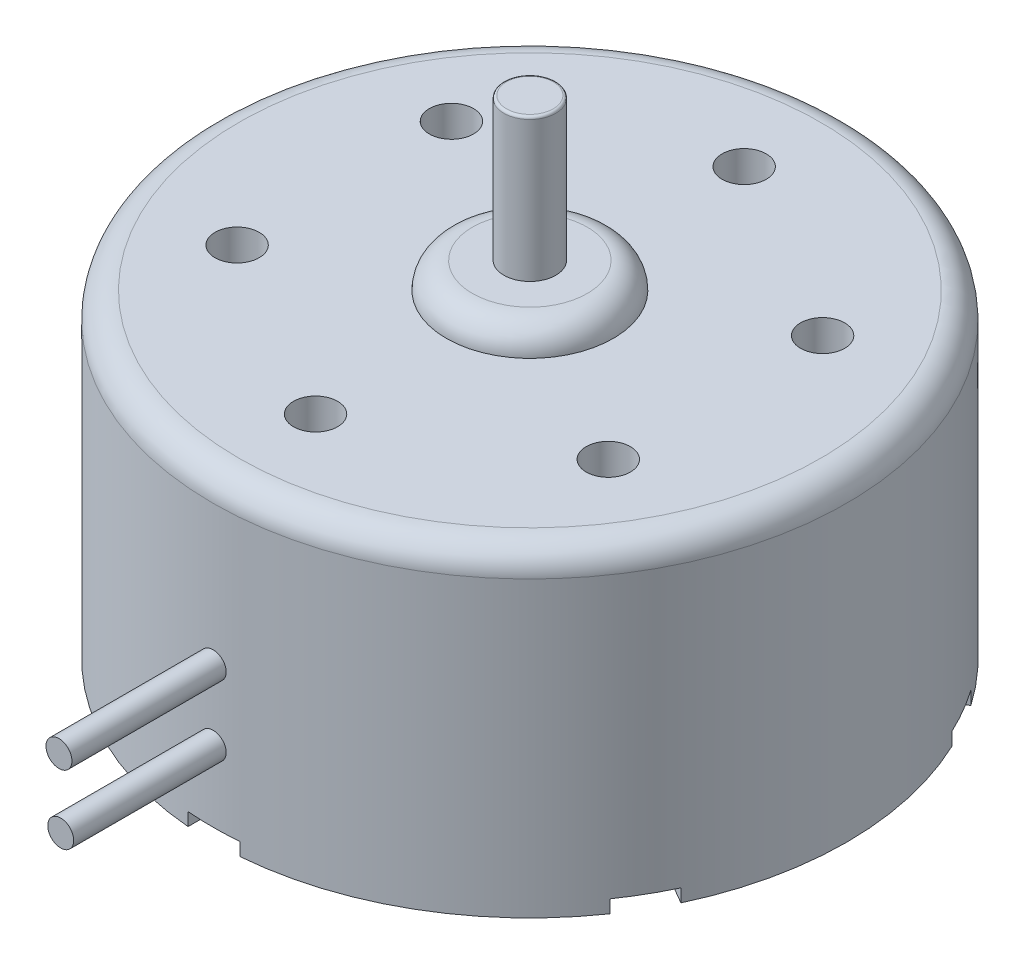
ISO-10303-21;
HEADER;
FILE_DESCRIPTION(('STEP AP214'),'2;1');
FILE_NAME('part.step','',(''),(''),'','','');
FILE_SCHEMA(('AUTOMOTIVE_DESIGN { 1 0 10303 214 1 1 1 1 }'));
ENDSEC;
DATA;
#1=APPLICATION_CONTEXT('core data for automotive mechanical design processes');
#2=APPLICATION_PROTOCOL_DEFINITION('international standard','automotive_design',2000,#1);
#3=PRODUCT_CONTEXT('',#1,'mechanical');
#4=PRODUCT('Part','Part','',(#3));
#5=PRODUCT_RELATED_PRODUCT_CATEGORY('part','',(#4));
#6=PRODUCT_DEFINITION_FORMATION('','',#4);
#7=PRODUCT_DEFINITION_CONTEXT('part definition',#1,'design');
#8=PRODUCT_DEFINITION('design','',#6,#7);
#9=PRODUCT_DEFINITION_SHAPE('','',#8);
#10=(LENGTH_UNIT() NAMED_UNIT(*) SI_UNIT(.MILLI.,.METRE.));
#11=(NAMED_UNIT(*) PLANE_ANGLE_UNIT() SI_UNIT($,.RADIAN.));
#12=(NAMED_UNIT(*) SI_UNIT($,.STERADIAN.) SOLID_ANGLE_UNIT());
#13=UNCERTAINTY_MEASURE_WITH_UNIT(LENGTH_MEASURE(1.E-05),#10,'distance_accuracy_value','');
#14=(GEOMETRIC_REPRESENTATION_CONTEXT(3) GLOBAL_UNCERTAINTY_ASSIGNED_CONTEXT((#13)) GLOBAL_UNIT_ASSIGNED_CONTEXT((#10,
#11,#12)) REPRESENTATION_CONTEXT('',''));
#15=CARTESIAN_POINT('',(0.,0.,0.));
#16=DIRECTION('',(0.,0.,1.));
#17=DIRECTION('',(1.,0.,0.));
#18=AXIS2_PLACEMENT_3D('',#15,#16,#17);
#19=CARTESIAN_POINT('',(0.911703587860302,0.351314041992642,9.53850270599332));
#20=DIRECTION('',(0.,0.,1.));
#21=DIRECTION('',(0.,-1.,0.));
#22=AXIS2_PLACEMENT_3D('',#19,#20,#21);
#23=CYLINDRICAL_SURFACE('',#22,0.5);
#24=CARTESIAN_POINT('',(0.911703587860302,0.351314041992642,9.53850270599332));
#25=DIRECTION('',(0.,0.,-1.));
#26=DIRECTION('',(0.,1.,0.));
#27=AXIS2_PLACEMENT_3D('',#24,#25,#26);
#28=CIRCLE('',#27,0.5);
#29=CARTESIAN_POINT('',(0.911703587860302,0.851314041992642,9.53850270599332));
#30=VERTEX_POINT('',#29);
#31=EDGE_CURVE('P0_E9',#30,#30,#28,.T.);
#32=ORIENTED_EDGE('',*,*,#31,.F.);
#33=EDGE_LOOP('',(#32));
#34=FACE_BOUND('',#33,.T.);
#35=CARTESIAN_POINT('',(0.911703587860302,0.35131404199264,19.5385027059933));
#36=DIRECTION('',(0.,0.,-1.));
#37=DIRECTION('',(0.,1.,0.));
#38=AXIS2_PLACEMENT_3D('',#35,#36,#37);
#39=CIRCLE('',#38,0.5);
#40=CARTESIAN_POINT('',(0.911703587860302,0.851314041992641,19.5385027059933));
#41=VERTEX_POINT('',#40);
#42=EDGE_CURVE('P0_E19',#41,#41,#39,.T.);
#43=ORIENTED_EDGE('',*,*,#42,.T.);
#44=EDGE_LOOP('',(#43));
#45=FACE_BOUND('',#44,.T.);
#46=ADVANCED_FACE('P0_F13',(#34,#45),#23,.T.);
#47=CARTESIAN_POINT('',(0.911703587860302,0.351314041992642,9.53850270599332));
#48=DIRECTION('',(0.,0.,-1.));
#49=DIRECTION('',(0.,1.,0.));
#50=AXIS2_PLACEMENT_3D('',#47,#48,#49);
#51=PLANE('',#50);
#52=ORIENTED_EDGE('',*,*,#31,.T.);
#53=EDGE_LOOP('',(#52));
#54=FACE_BOUND('',#53,.T.);
#55=ADVANCED_FACE('P0_F28',(#54),#51,.T.);
#56=CARTESIAN_POINT('',(0.911703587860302,0.35131404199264,19.5385027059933));
#57=DIRECTION('',(0.,0.,-1.));
#58=DIRECTION('',(0.,1.,0.));
#59=AXIS2_PLACEMENT_3D('',#56,#57,#58);
#60=PLANE('',#59);
#61=ORIENTED_EDGE('',*,*,#42,.F.);
#62=EDGE_LOOP('',(#61));
#63=FACE_BOUND('',#62,.T.);
#64=ADVANCED_FACE('P0_F26',(#63),#60,.F.);
#65=CLOSED_SHELL('',(#46,#55,#64));
#66=MANIFOLD_SOLID_BREP('P0_B1',#65);
#67=CARTESIAN_POINT('',(0.911703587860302,15.9152198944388,1.47878346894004));
#68=DIRECTION('',(0.,-1.,0.));
#69=DIRECTION('',(0.509351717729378,0.,0.860558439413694));
#70=AXIS2_PLACEMENT_3D('',#67,#68,#69);
#71=CYLINDRICAL_SURFACE('',#70,1.);
#72=CARTESIAN_POINT('',(0.911703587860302,-2.78478010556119,1.47878346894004));
#73=DIRECTION('',(0.,1.,0.));
#74=DIRECTION('',(-0.509351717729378,0.,-0.860558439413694));
#75=AXIS2_PLACEMENT_3D('',#72,#73,#74);
#76=CIRCLE('',#75,1.);
#77=CARTESIAN_POINT('',(0.402351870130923,-2.78478010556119,0.618225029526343));
#78=VERTEX_POINT('',#77);
#79=EDGE_CURVE('P1_E20',#78,#78,#76,.T.);
#80=ORIENTED_EDGE('',*,*,#79,.T.);
#81=EDGE_LOOP('',(#80));
#82=FACE_BOUND('',#81,.T.);
#83=CARTESIAN_POINT('',(0.911703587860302,15.8152198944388,1.47878346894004));
#84=DIRECTION('',(0.,1.,0.));
#85=DIRECTION('',(-0.509351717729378,0.,-0.860558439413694));
#86=AXIS2_PLACEMENT_3D('',#83,#84,#85);
#87=CIRCLE('',#86,1.);
#88=CARTESIAN_POINT('',(0.402351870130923,15.8152198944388,0.618225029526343));
#89=VERTEX_POINT('',#88);
#90=EDGE_CURVE('P1_E24',#89,#89,#87,.F.);
#91=ORIENTED_EDGE('',*,*,#90,.T.);
#92=EDGE_LOOP('',(#91));
#93=FACE_BOUND('',#92,.T.);
#94=ADVANCED_FACE('P1_F14',(#82,#93),#71,.T.);
#95=CARTESIAN_POINT('',(0.911703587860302,15.9152198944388,1.47878346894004));
#96=DIRECTION('',(0.,1.,0.));
#97=DIRECTION('',(-0.509351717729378,0.,-0.860558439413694));
#98=AXIS2_PLACEMENT_3D('',#95,#96,#97);
#99=PLANE('',#98);
#100=CARTESIAN_POINT('',(0.911703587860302,15.9152198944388,1.47878346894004));
#101=DIRECTION('',(0.,1.,0.));
#102=DIRECTION('',(-0.509351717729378,0.,-0.860558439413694));
#103=AXIS2_PLACEMENT_3D('',#100,#101,#102);
#104=CIRCLE('',#103,0.900000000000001);
#105=CARTESIAN_POINT('',(0.453287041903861,15.9152198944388,0.704280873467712));
#106=VERTEX_POINT('',#105);
#107=EDGE_CURVE('P1_E28',#106,#106,#104,.T.);
#108=ORIENTED_EDGE('',*,*,#107,.T.);
#109=EDGE_LOOP('',(#108));
#110=FACE_BOUND('',#109,.T.);
#111=ADVANCED_FACE('P1_F34',(#110),#99,.T.);
#112=CARTESIAN_POINT('',(0.911703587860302,-2.88478010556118,1.47878346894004));
#113=DIRECTION('',(0.,1.,0.));
#114=DIRECTION('',(-0.509351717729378,0.,-0.860558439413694));
#115=AXIS2_PLACEMENT_3D('',#112,#113,#114);
#116=PLANE('',#115);
#117=CARTESIAN_POINT('',(0.911703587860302,-2.88478010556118,1.47878346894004));
#118=DIRECTION('',(0.,1.,0.));
#119=DIRECTION('',(-0.509351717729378,0.,-0.860558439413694));
#120=AXIS2_PLACEMENT_3D('',#117,#118,#119);
#121=CIRCLE('',#120,0.900000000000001);
#122=CARTESIAN_POINT('',(0.453287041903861,-2.88478010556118,0.704280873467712));
#123=VERTEX_POINT('',#122);
#124=EDGE_CURVE('P1_E10',#123,#123,#121,.F.);
#125=ORIENTED_EDGE('',*,*,#124,.T.);
#126=EDGE_LOOP('',(#125));
#127=FACE_BOUND('',#126,.T.);
#128=ADVANCED_FACE('P1_F39',(#127),#116,.F.);
#129=CARTESIAN_POINT('',(0.911703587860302,15.8152198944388,1.47878346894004));
#130=DIRECTION('',(0.,1.,0.));
#131=DIRECTION('',(-0.509351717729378,0.,-0.860558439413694));
#132=AXIS2_PLACEMENT_3D('',#129,#130,#131);
#133=TOROIDAL_SURFACE('',#132,0.900000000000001,0.1);
#134=ORIENTED_EDGE('',*,*,#90,.F.);
#135=EDGE_LOOP('',(#134));
#136=FACE_BOUND('',#135,.T.);
#137=ORIENTED_EDGE('',*,*,#107,.F.);
#138=EDGE_LOOP('',(#137));
#139=FACE_BOUND('',#138,.T.);
#140=ADVANCED_FACE('P1_F36',(#136,#139),#133,.T.);
#141=CARTESIAN_POINT('',(0.911703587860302,-2.78478010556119,1.47878346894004));
#142=DIRECTION('',(0.,1.,0.));
#143=DIRECTION('',(-0.509351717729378,0.,-0.860558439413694));
#144=AXIS2_PLACEMENT_3D('',#141,#142,#143);
#145=TOROIDAL_SURFACE('',#144,0.900000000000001,0.1);
#146=ORIENTED_EDGE('',*,*,#124,.F.);
#147=EDGE_LOOP('',(#146));
#148=FACE_BOUND('',#147,.T.);
#149=ORIENTED_EDGE('',*,*,#79,.F.);
#150=EDGE_LOOP('',(#149));
#151=FACE_BOUND('',#150,.T.);
#152=ADVANCED_FACE('P1_F38',(#148,#151),#145,.T.);
#153=CLOSED_SHELL('',(#94,#111,#128,#140,#152));
#154=MANIFOLD_SOLID_BREP('P1_B1',#153);
#155=CARTESIAN_POINT('',(0.911703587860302,9.41521989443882,1.47878346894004));
#156=DIRECTION('',(0.,-1.,0.));
#157=DIRECTION('',(0.,0.,-1.));
#158=AXIS2_PLACEMENT_3D('',#155,#156,#157);
#159=CYLINDRICAL_SURFACE('',#158,12.2);
#160=CARTESIAN_POINT('',(0.911703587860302,8.41521989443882,1.47878346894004));
#161=DIRECTION('',(0.,1.,0.));
#162=DIRECTION('',(0.,0.,1.));
#163=AXIS2_PLACEMENT_3D('',#160,#161,#162);
#164=CIRCLE('',#163,12.2);
#165=CARTESIAN_POINT('',(0.911703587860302,8.41521989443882,13.67878346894));
#166=VERTEX_POINT('',#165);
#167=EDGE_CURVE('P2_E11',#166,#166,#164,.F.);
#168=ORIENTED_EDGE('',*,*,#167,.T.);
#169=EDGE_LOOP('',(#168));
#170=FACE_BOUND('',#169,.T.);
#171=DIRECTION('',(0.,-1.,0.));
#172=VECTOR('',#171,1.);
#173=CARTESIAN_POINT('',(-10.1182536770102,9.41521989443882,-3.73466478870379));
#174=LINE('',#173,#172);
#175=CARTESIAN_POINT('',(-10.1182536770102,-2.88478010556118,-3.73466478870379));
#176=VERTEX_POINT('',#175);
#177=CARTESIAN_POINT('',(-10.1182536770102,-2.38478010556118,-3.73466478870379));
#178=VERTEX_POINT('',#177);
#179=EDGE_CURVE('P2_E199',#176,#178,#174,.F.);
#180=ORIENTED_EDGE('',*,*,#179,.F.);
#181=CARTESIAN_POINT('',(0.911703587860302,-2.88478010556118,1.47878346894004));
#182=DIRECTION('',(0.,1.,0.));
#183=DIRECTION('',(0.,0.,1.));
#184=AXIS2_PLACEMENT_3D('',#181,#182,#183);
#185=CIRCLE('',#184,12.2);
#186=CARTESIAN_POINT('',(-10.1182536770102,-2.88478010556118,6.69223172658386));
#187=VERTEX_POINT('',#186);
#188=EDGE_CURVE('P2_E318',#176,#187,#185,.T.);
#189=ORIENTED_EDGE('',*,*,#188,.T.);
#190=DIRECTION('',(0.,-1.,0.));
#191=VECTOR('',#190,1.);
#192=CARTESIAN_POINT('',(-10.1182536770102,9.41521989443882,6.69223172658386));
#193=LINE('',#192,#191);
#194=CARTESIAN_POINT('',(-10.1182536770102,-2.38478010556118,6.69223172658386));
#195=VERTEX_POINT('',#194);
#196=EDGE_CURVE('P2_E329',#187,#195,#193,.F.);
#197=ORIENTED_EDGE('',*,*,#196,.T.);
#198=CARTESIAN_POINT('',(0.911703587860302,-2.38478010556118,1.47878346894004));
#199=DIRECTION('',(0.,-1.,0.));
#200=DIRECTION('',(0.,0.,-1.));
#201=AXIS2_PLACEMENT_3D('',#198,#199,#200);
#202=CIRCLE('',#201,12.2);
#203=CARTESIAN_POINT('',(-9.11825367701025,-2.38478010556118,8.42428253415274));
#204=VERTEX_POINT('',#203);
#205=EDGE_CURVE('P2_E292',#195,#204,#202,.F.);
#206=ORIENTED_EDGE('',*,*,#205,.T.);
#207=DIRECTION('',(0.,-1.,0.));
#208=VECTOR('',#207,1.);
#209=CARTESIAN_POINT('',(-9.11825367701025,9.41521989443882,8.42428253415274));
#210=LINE('',#209,#208);
#211=CARTESIAN_POINT('',(-9.11825367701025,-2.88478010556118,8.42428253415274));
#212=VERTEX_POINT('',#211);
#213=EDGE_CURVE('P2_E332',#212,#204,#210,.F.);
#214=ORIENTED_EDGE('',*,*,#213,.F.);
#215=CARTESIAN_POINT('',(-0.0882964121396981,-2.88478010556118,13.6377307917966));
#216=VERTEX_POINT('',#215);
#217=EDGE_CURVE('P2_E319',#212,#216,#185,.T.);
#218=ORIENTED_EDGE('',*,*,#217,.T.);
#219=DIRECTION('',(0.,-1.,0.));
#220=VECTOR('',#219,1.);
#221=CARTESIAN_POINT('',(-0.0882964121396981,9.41521989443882,13.6377307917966));
#222=LINE('',#221,#220);
#223=CARTESIAN_POINT('',(-0.0882964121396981,-2.38478010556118,13.6377307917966));
#224=VERTEX_POINT('',#223);
#225=EDGE_CURVE('P2_E338',#216,#224,#222,.F.);
#226=ORIENTED_EDGE('',*,*,#225,.T.);
#227=CARTESIAN_POINT('',(0.911703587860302,-2.38478010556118,1.47878346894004));
#228=DIRECTION('',(0.,-1.,0.));
#229=DIRECTION('',(0.,0.,-1.));
#230=AXIS2_PLACEMENT_3D('',#227,#228,#229);
#231=CIRCLE('',#230,12.2);
#232=CARTESIAN_POINT('',(1.9117035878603,-2.38478010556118,13.6377307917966));
#233=VERTEX_POINT('',#232);
#234=EDGE_CURVE('P2_E273',#224,#233,#231,.F.);
#235=ORIENTED_EDGE('',*,*,#234,.T.);
#236=DIRECTION('',(0.,-1.,0.));
#237=VECTOR('',#236,1.);
#238=CARTESIAN_POINT('',(1.9117035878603,9.41521989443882,13.6377307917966));
#239=LINE('',#238,#237);
#240=CARTESIAN_POINT('',(1.9117035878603,-2.88478010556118,13.6377307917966));
#241=VERTEX_POINT('',#240);
#242=EDGE_CURVE('P2_E341',#241,#233,#239,.F.);
#243=ORIENTED_EDGE('',*,*,#242,.F.);
#244=CARTESIAN_POINT('',(10.9416608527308,-2.88478010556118,8.42428253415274));
#245=VERTEX_POINT('',#244);
#246=EDGE_CURVE('P2_E323',#241,#245,#185,.T.);
#247=ORIENTED_EDGE('',*,*,#246,.T.);
#248=DIRECTION('',(0.,-1.,0.));
#249=VECTOR('',#248,1.);
#250=CARTESIAN_POINT('',(10.9416608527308,9.41521989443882,8.42428253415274));
#251=LINE('',#250,#249);
#252=CARTESIAN_POINT('',(10.9416608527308,-2.38478010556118,8.42428253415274));
#253=VERTEX_POINT('',#252);
#254=EDGE_CURVE('P2_E347',#245,#253,#251,.F.);
#255=ORIENTED_EDGE('',*,*,#254,.T.);
#256=CARTESIAN_POINT('',(0.911703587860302,-2.38478010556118,1.47878346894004));
#257=DIRECTION('',(0.,-1.,0.));
#258=DIRECTION('',(0.,0.,-1.));
#259=AXIS2_PLACEMENT_3D('',#256,#257,#258);
#260=CIRCLE('',#259,12.2);
#261=CARTESIAN_POINT('',(11.9416608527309,-2.38478010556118,6.69223172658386));
#262=VERTEX_POINT('',#261);
#263=EDGE_CURVE('P2_E254',#253,#262,#260,.F.);
#264=ORIENTED_EDGE('',*,*,#263,.T.);
#265=DIRECTION('',(0.,-1.,0.));
#266=VECTOR('',#265,1.);
#267=CARTESIAN_POINT('',(11.9416608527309,9.41521989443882,6.69223172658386));
#268=LINE('',#267,#266);
#269=CARTESIAN_POINT('',(11.9416608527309,-2.88478010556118,6.69223172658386));
#270=VERTEX_POINT('',#269);
#271=EDGE_CURVE('P2_E350',#270,#262,#268,.F.);
#272=ORIENTED_EDGE('',*,*,#271,.F.);
#273=CARTESIAN_POINT('',(11.9416608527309,-2.88478010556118,-3.73466478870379));
#274=VERTEX_POINT('',#273);
#275=EDGE_CURVE('P2_E507',#270,#274,#185,.T.);
#276=ORIENTED_EDGE('',*,*,#275,.T.);
#277=DIRECTION('',(0.,-1.,0.));
#278=VECTOR('',#277,1.);
#279=CARTESIAN_POINT('',(11.9416608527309,9.41521989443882,-3.73466478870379));
#280=LINE('',#279,#278);
#281=CARTESIAN_POINT('',(11.9416608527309,-2.38478010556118,-3.73466478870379));
#282=VERTEX_POINT('',#281);
#283=EDGE_CURVE('P2_E356',#274,#282,#280,.F.);
#284=ORIENTED_EDGE('',*,*,#283,.T.);
#285=CARTESIAN_POINT('',(0.911703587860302,-2.38478010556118,1.47878346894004));
#286=DIRECTION('',(0.,-1.,0.));
#287=DIRECTION('',(0.,0.,-1.));
#288=AXIS2_PLACEMENT_3D('',#285,#286,#287);
#289=CIRCLE('',#288,12.2);
#290=CARTESIAN_POINT('',(10.9416608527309,-2.38478010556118,-5.46671559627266));
#291=VERTEX_POINT('',#290);
#292=EDGE_CURVE('P2_E235',#282,#291,#289,.F.);
#293=ORIENTED_EDGE('',*,*,#292,.T.);
#294=DIRECTION('',(0.,-1.,0.));
#295=VECTOR('',#294,1.);
#296=CARTESIAN_POINT('',(10.9416608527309,9.41521989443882,-5.46671559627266));
#297=LINE('',#296,#295);
#298=CARTESIAN_POINT('',(10.9416608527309,-2.88478010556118,-5.46671559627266));
#299=VERTEX_POINT('',#298);
#300=EDGE_CURVE('P2_E359',#299,#291,#297,.F.);
#301=ORIENTED_EDGE('',*,*,#300,.F.);
#302=CARTESIAN_POINT('',(1.9117035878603,-2.88478010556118,-10.6801638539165));
#303=VERTEX_POINT('',#302);
#304=EDGE_CURVE('P2_E503',#299,#303,#185,.T.);
#305=ORIENTED_EDGE('',*,*,#304,.T.);
#306=DIRECTION('',(0.,-1.,0.));
#307=VECTOR('',#306,1.);
#308=CARTESIAN_POINT('',(1.9117035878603,9.41521989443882,-10.6801638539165));
#309=LINE('',#308,#307);
#310=CARTESIAN_POINT('',(1.9117035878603,-2.38478010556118,-10.6801638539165));
#311=VERTEX_POINT('',#310);
#312=EDGE_CURVE('P2_E365',#303,#311,#309,.F.);
#313=ORIENTED_EDGE('',*,*,#312,.T.);
#314=CARTESIAN_POINT('',(0.911703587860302,-2.38478010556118,1.47878346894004));
#315=DIRECTION('',(0.,-1.,0.));
#316=DIRECTION('',(0.,0.,-1.));
#317=AXIS2_PLACEMENT_3D('',#314,#315,#316);
#318=CIRCLE('',#317,12.2);
#319=CARTESIAN_POINT('',(-0.0882964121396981,-2.38478010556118,-10.6801638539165));
#320=VERTEX_POINT('',#319);
#321=EDGE_CURVE('P2_E216',#311,#320,#318,.F.);
#322=ORIENTED_EDGE('',*,*,#321,.T.);
#323=DIRECTION('',(0.,-1.,0.));
#324=VECTOR('',#323,1.);
#325=CARTESIAN_POINT('',(-0.0882964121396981,9.41521989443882,-10.6801638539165));
#326=LINE('',#325,#324);
#327=CARTESIAN_POINT('',(-0.0882964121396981,-2.88478010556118,-10.6801638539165));
#328=VERTEX_POINT('',#327);
#329=EDGE_CURVE('P2_E368',#328,#320,#326,.F.);
#330=ORIENTED_EDGE('',*,*,#329,.F.);
#331=CARTESIAN_POINT('',(-9.11825367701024,-2.88478010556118,-5.46671559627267));
#332=VERTEX_POINT('',#331);
#333=EDGE_CURVE('P2_E501',#328,#332,#185,.T.);
#334=ORIENTED_EDGE('',*,*,#333,.T.);
#335=DIRECTION('',(0.,-1.,0.));
#336=VECTOR('',#335,1.);
#337=CARTESIAN_POINT('',(-9.11825367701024,9.41521989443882,-5.46671559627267));
#338=LINE('',#337,#336);
#339=CARTESIAN_POINT('',(-9.11825367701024,-2.38478010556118,-5.46671559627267));
#340=VERTEX_POINT('',#339);
#341=EDGE_CURVE('P2_E373',#332,#340,#338,.F.);
#342=ORIENTED_EDGE('',*,*,#341,.T.);
#343=CARTESIAN_POINT('',(0.911703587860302,-2.38478010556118,1.47878346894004));
#344=DIRECTION('',(0.,-1.,0.));
#345=DIRECTION('',(0.,0.,-1.));
#346=AXIS2_PLACEMENT_3D('',#343,#344,#345);
#347=CIRCLE('',#346,12.2);
#348=EDGE_CURVE('P2_E201',#340,#178,#347,.F.);
#349=ORIENTED_EDGE('',*,*,#348,.T.);
#350=EDGE_LOOP('',(#180,#189,#197,#206,#214,#218,#226,#235,#243,#247,#255,#264,#272,#276,#284,
#293,#301,#305,#313,#322,#330,#334,#342,#349));
#351=FACE_BOUND('',#350,.T.);
#352=CARTESIAN_POINT('',(0.911703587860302,2.53563824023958,13.67878346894));
#353=CARTESIAN_POINT('',(0.939776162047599,2.53563948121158,13.678783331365));
#354=CARTESIAN_POINT('',(0.96786879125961,2.53801038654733,13.6786855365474));
#355=CARTESIAN_POINT('',(1.02327949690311,2.54743501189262,13.6783048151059));
#356=CARTESIAN_POINT('',(1.05059661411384,2.55449428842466,13.6780216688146));
#357=CARTESIAN_POINT('',(1.10364557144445,2.57309357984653,13.6773023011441));
#358=CARTESIAN_POINT('',(1.12937819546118,2.58463135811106,13.6768661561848));
#359=CARTESIAN_POINT('',(1.17853431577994,2.61185681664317,13.6758899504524));
#360=CARTESIAN_POINT('',(1.20195836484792,2.62754350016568,13.6753499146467));
#361=CARTESIAN_POINT('',(1.24585651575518,2.6626343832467,13.6742262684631));
#362=CARTESIAN_POINT('',(1.26632875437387,2.68204091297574,13.6736426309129));
#363=CARTESIAN_POINT('',(1.30372634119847,2.72401614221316,13.672497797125));
#364=CARTESIAN_POINT('',(1.32065154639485,2.74658496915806,13.6719366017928));
#365=CARTESIAN_POINT('',(1.35047904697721,2.79425300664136,13.6708997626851));
#366=CARTESIAN_POINT('',(1.36337999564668,2.81935306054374,13.6704241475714));
#367=CARTESIAN_POINT('',(1.38478409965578,2.87136509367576,13.6696124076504));
#368=CARTESIAN_POINT('',(1.3932872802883,2.89827706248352,13.6692762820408));
#369=CARTESIAN_POINT('',(1.40564984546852,2.95313282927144,13.668781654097));
#370=CARTESIAN_POINT('',(1.40951186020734,2.98107603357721,13.6686230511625));
#371=CARTESIAN_POINT('',(1.41249057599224,3.03721454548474,13.6685010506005));
#372=CARTESIAN_POINT('',(1.41160730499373,3.06540985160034,13.6685376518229));
#373=CARTESIAN_POINT('',(1.40512272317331,3.12123435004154,13.668801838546));
#374=CARTESIAN_POINT('',(1.39952425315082,3.14886387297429,13.669029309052));
#375=CARTESIAN_POINT('',(1.38377259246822,3.2027906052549,13.6696494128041));
#376=CARTESIAN_POINT('',(1.37361938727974,3.22908781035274,13.6700420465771));
#377=CARTESIAN_POINT('',(1.3490432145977,3.27961258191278,13.6709483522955));
#378=CARTESIAN_POINT('',(1.33461894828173,3.30383951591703,13.6714620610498));
#379=CARTESIAN_POINT('',(1.30191105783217,3.3495291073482,13.6725525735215));
#380=CARTESIAN_POINT('',(1.28362741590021,3.37099175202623,13.6731293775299));
#381=CARTESIAN_POINT('',(1.24370372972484,3.41056005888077,13.6742815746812));
#382=CARTESIAN_POINT('',(1.22206122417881,3.42866323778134,13.6748569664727));
#383=CARTESIAN_POINT('',(1.17604282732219,3.46097960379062,13.675941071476));
#384=CARTESIAN_POINT('',(1.15166693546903,3.47519279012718,13.6764497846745));
#385=CARTESIAN_POINT('',(1.10087229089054,3.49932545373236,13.6773432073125));
#386=CARTESIAN_POINT('',(1.07445349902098,3.50924484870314,13.6777279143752));
#387=CARTESIAN_POINT('',(1.02032361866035,3.52450675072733,13.6783299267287));
#388=CARTESIAN_POINT('',(0.992612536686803,3.52984928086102,13.6785472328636));
#389=CARTESIAN_POINT('',(0.936706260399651,3.53580274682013,13.6787898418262));
#390=CARTESIAN_POINT('',(0.908511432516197,3.5364171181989,13.6788152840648));
#391=CARTESIAN_POINT('',(0.852419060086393,3.53290578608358,13.6786716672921));
#392=CARTESIAN_POINT('',(0.82452151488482,3.52878009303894,13.6785026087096));
#393=CARTESIAN_POINT('',(0.769825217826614,3.51590858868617,13.6779891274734));
#394=CARTESIAN_POINT('',(0.743026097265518,3.50716434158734,13.6776447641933));
#395=CARTESIAN_POINT('',(0.691276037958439,3.48530553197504,13.6768194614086));
#396=CARTESIAN_POINT('',(0.666325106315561,3.47219095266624,13.676338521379));
#397=CARTESIAN_POINT('',(0.618963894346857,3.44195493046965,13.6752938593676));
#398=CARTESIAN_POINT('',(0.596555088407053,3.42483117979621,13.6747300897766));
#399=CARTESIAN_POINT('',(0.554929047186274,3.38706627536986,13.6735834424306));
#400=CARTESIAN_POINT('',(0.535711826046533,3.36642510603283,13.6730005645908));
#401=CARTESIAN_POINT('',(0.501002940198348,3.32219653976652,13.6718810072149));
#402=CARTESIAN_POINT('',(0.485513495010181,3.29860740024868,13.6713443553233));
#403=CARTESIAN_POINT('',(0.458715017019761,3.24916134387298,13.6703781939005));
#404=CARTESIAN_POINT('',(0.447405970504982,3.22330443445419,13.6699486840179));
#405=CARTESIAN_POINT('',(0.429293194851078,3.1700651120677,13.6692454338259));
#406=CARTESIAN_POINT('',(0.422488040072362,3.14268318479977,13.6689716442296));
#407=CARTESIAN_POINT('',(0.413571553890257,3.08716426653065,13.6686105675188));
#408=CARTESIAN_POINT('',(0.41146020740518,3.05902727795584,13.6685232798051));
#409=CARTESIAN_POINT('',(0.41199143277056,3.00281907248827,13.6685450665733));
#410=CARTESIAN_POINT('',(0.414630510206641,2.9747478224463,13.6686539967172));
#411=CARTESIAN_POINT('',(0.424580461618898,2.91944722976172,13.6690556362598));
#412=CARTESIAN_POINT('',(0.431891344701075,2.8922178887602,13.6693483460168));
#413=CARTESIAN_POINT('',(0.450976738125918,2.83937312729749,13.6700845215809));
#414=CARTESIAN_POINT('',(0.462751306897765,2.81375772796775,13.6705279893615));
#415=CARTESIAN_POINT('',(0.490429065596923,2.76486744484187,13.6715156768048));
#416=CARTESIAN_POINT('',(0.506332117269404,2.74159248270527,13.6720598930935));
#417=CARTESIAN_POINT('',(0.541827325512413,2.69802669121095,13.6731881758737));
#418=CARTESIAN_POINT('',(0.561421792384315,2.6777377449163,13.6737722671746));
#419=CARTESIAN_POINT('',(0.603744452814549,2.64073140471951,13.6749143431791));
#420=CARTESIAN_POINT('',(0.626473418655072,2.6240148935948,13.6754723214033));
#421=CARTESIAN_POINT('',(0.674433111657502,2.59462269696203,13.676499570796));
#422=CARTESIAN_POINT('',(0.699665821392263,2.58195024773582,13.6769687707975));
#423=CARTESIAN_POINT('',(0.751883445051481,2.56103656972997,13.6777644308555));
#424=CARTESIAN_POINT('',(0.778866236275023,2.55279008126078,13.6780910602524));
#425=CARTESIAN_POINT('',(0.823632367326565,2.54313694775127,13.678477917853));
#426=CARTESIAN_POINT('',(0.841125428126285,2.54032849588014,13.6785919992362));
#427=CARTESIAN_POINT('',(0.876310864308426,2.53657875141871,13.6787448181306));
#428=CARTESIAN_POINT('',(0.894003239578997,2.53563745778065,13.678783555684));
#429=CARTESIAN_POINT('',(0.911703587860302,2.53563824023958,13.67878346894));
#430=B_SPLINE_CURVE_WITH_KNOTS('',3,(#352,#353,#354,#355,#356,#357,#358,#359,#360,#361,#362,
#363,#364,#365,#366,#367,#368,#369,#370,#371,#372,#373,#374,#375,#376,#377,#378,#379,#380,#381,
#382,#383,#384,#385,#386,#387,#388,#389,#390,#391,#392,#393,#394,#395,#396,#397,#398,#399,#400,
#401,#402,#403,#404,#405,#406,#407,#408,#409,#410,#411,#412,#413,#414,#415,#416,#417,#418,#419,
#420,#421,#422,#423,#424,#425,#426,#427,#428,#429),.UNSPECIFIED.,.T.,.F.,(4,2,2,2,2,2,2,2,2,2,2,
2,2,2,2,2,2,2,2,2,2,2,2,2,2,2,2,2,2,2,2,2,2,2,2,2,2,2,4),(0.,0.0841531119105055,
0.168406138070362,0.252617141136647,0.336807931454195,0.421051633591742,0.505298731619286,
0.589573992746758,0.673848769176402,0.758075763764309,0.842302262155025,0.926478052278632,
1.01065411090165,1.09485579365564,1.17905786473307,1.26332193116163,1.34758601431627,
1.43185171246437,1.51611698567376,1.60032102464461,1.68452487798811,1.76870023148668,
1.85287590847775,1.93710015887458,2.02132478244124,2.1055994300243,2.18987380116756,
2.27412148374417,2.35836889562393,2.44255436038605,2.52673998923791,2.61092672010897,
2.69511063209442,2.77934740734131,2.86360497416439,2.94792980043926,3.03215419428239,
3.08521453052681,3.13827483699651),.UNSPECIFIED.);
#431=CARTESIAN_POINT('',(0.911703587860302,2.53563824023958,13.67878346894));
#432=VERTEX_POINT('',#431);
#433=EDGE_CURVE('P2_E385',#432,#432,#430,.T.);
#434=ORIENTED_EDGE('',*,*,#433,.F.);
#435=EDGE_LOOP('',(#434));
#436=FACE_BOUND('',#435,.T.);
#437=CARTESIAN_POINT('',(0.911703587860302,-0.148685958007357,13.67878346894));
#438=CARTESIAN_POINT('',(0.939776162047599,-0.14868471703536,13.678783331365));
#439=CARTESIAN_POINT('',(0.96786879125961,-0.146313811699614,13.6786855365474));
#440=CARTESIAN_POINT('',(1.02327949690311,-0.136889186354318,13.6783048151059));
#441=CARTESIAN_POINT('',(1.05059661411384,-0.129829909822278,13.6780216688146));
#442=CARTESIAN_POINT('',(1.10364557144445,-0.111230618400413,13.6773023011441));
#443=CARTESIAN_POINT('',(1.12937819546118,-0.0996928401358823,13.6768661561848));
#444=CARTESIAN_POINT('',(1.17853431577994,-0.0724673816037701,13.6758899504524));
#445=CARTESIAN_POINT('',(1.20195836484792,-0.0567806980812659,13.6753499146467));
#446=CARTESIAN_POINT('',(1.24585651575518,-0.0216898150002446,13.6742262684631));
#447=CARTESIAN_POINT('',(1.26632875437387,-0.00228328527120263,13.6736426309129));
#448=CARTESIAN_POINT('',(1.30372634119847,0.0396919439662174,13.672497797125));
#449=CARTESIAN_POINT('',(1.32065154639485,0.0622607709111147,13.6719366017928));
#450=CARTESIAN_POINT('',(1.3504790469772,0.109928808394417,13.6708997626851));
#451=CARTESIAN_POINT('',(1.36337999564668,0.135028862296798,13.6704241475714));
#452=CARTESIAN_POINT('',(1.38478409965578,0.187040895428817,13.6696124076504));
#453=CARTESIAN_POINT('',(1.3932872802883,0.21395286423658,13.6692762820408));
#454=CARTESIAN_POINT('',(1.40564984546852,0.268808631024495,13.668781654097));
#455=CARTESIAN_POINT('',(1.40951186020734,0.296751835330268,13.6686230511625));
#456=CARTESIAN_POINT('',(1.41249057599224,0.352890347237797,13.6685010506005));
#457=CARTESIAN_POINT('',(1.41160730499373,0.381085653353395,13.6685376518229));
#458=CARTESIAN_POINT('',(1.40512272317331,0.436910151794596,13.668801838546));
#459=CARTESIAN_POINT('',(1.39952425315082,0.464539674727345,13.669029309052));
#460=CARTESIAN_POINT('',(1.38377259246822,0.518466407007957,13.6696494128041));
#461=CARTESIAN_POINT('',(1.37361938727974,0.544763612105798,13.6700420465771));
#462=CARTESIAN_POINT('',(1.3490432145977,0.595288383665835,13.6709483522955));
#463=CARTESIAN_POINT('',(1.33461894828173,0.619515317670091,13.6714620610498));
#464=CARTESIAN_POINT('',(1.30191105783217,0.665204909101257,13.6725525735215));
#465=CARTESIAN_POINT('',(1.28362741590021,0.686667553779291,13.6731293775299));
#466=CARTESIAN_POINT('',(1.24370372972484,0.726235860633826,13.6742815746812));
#467=CARTESIAN_POINT('',(1.22206122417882,0.744339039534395,13.6748569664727));
#468=CARTESIAN_POINT('',(1.17604282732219,0.776655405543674,13.675941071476));
#469=CARTESIAN_POINT('',(1.15166693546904,0.790868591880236,13.6764497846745));
#470=CARTESIAN_POINT('',(1.10087229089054,0.815001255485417,13.6773432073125));
#471=CARTESIAN_POINT('',(1.07445349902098,0.824920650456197,13.6777279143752));
#472=CARTESIAN_POINT('',(1.02032361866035,0.840182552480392,13.6783299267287));
#473=CARTESIAN_POINT('',(0.992612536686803,0.845525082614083,13.6785472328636));
#474=CARTESIAN_POINT('',(0.936706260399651,0.851478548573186,13.6787898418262));
#475=CARTESIAN_POINT('',(0.908511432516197,0.852092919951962,13.6788152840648));
#476=CARTESIAN_POINT('',(0.852419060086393,0.848581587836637,13.6786716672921));
#477=CARTESIAN_POINT('',(0.82452151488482,0.844455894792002,13.6785026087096));
#478=CARTESIAN_POINT('',(0.769825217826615,0.831584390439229,13.6779891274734));
#479=CARTESIAN_POINT('',(0.743026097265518,0.822840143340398,13.6776447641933));
#480=CARTESIAN_POINT('',(0.691276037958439,0.800981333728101,13.6768194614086));
#481=CARTESIAN_POINT('',(0.666325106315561,0.787866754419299,13.676338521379));
#482=CARTESIAN_POINT('',(0.618963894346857,0.757630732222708,13.6752938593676));
#483=CARTESIAN_POINT('',(0.596555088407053,0.740506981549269,13.6747300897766));
#484=CARTESIAN_POINT('',(0.554929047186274,0.702742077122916,13.6735834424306));
#485=CARTESIAN_POINT('',(0.535711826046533,0.682100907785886,13.6730005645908));
#486=CARTESIAN_POINT('',(0.501002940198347,0.637872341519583,13.6718810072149));
#487=CARTESIAN_POINT('',(0.48551349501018,0.614283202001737,13.6713443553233));
#488=CARTESIAN_POINT('',(0.458715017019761,0.564837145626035,13.6703781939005));
#489=CARTESIAN_POINT('',(0.447405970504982,0.538980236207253,13.6699486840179));
#490=CARTESIAN_POINT('',(0.429293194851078,0.485740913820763,13.6692454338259));
#491=CARTESIAN_POINT('',(0.422488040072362,0.458358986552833,13.6689716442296));
#492=CARTESIAN_POINT('',(0.413571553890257,0.40284006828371,13.6686105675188));
#493=CARTESIAN_POINT('',(0.411460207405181,0.374703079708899,13.6685232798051));
#494=CARTESIAN_POINT('',(0.41199143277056,0.318494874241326,13.6685450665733));
#495=CARTESIAN_POINT('',(0.414630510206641,0.290423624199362,13.6686539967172));
#496=CARTESIAN_POINT('',(0.424580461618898,0.235123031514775,13.6690556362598));
#497=CARTESIAN_POINT('',(0.431891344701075,0.207893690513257,13.6693483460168));
#498=CARTESIAN_POINT('',(0.450976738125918,0.15504892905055,13.6700845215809));
#499=CARTESIAN_POINT('',(0.462751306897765,0.129433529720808,13.6705279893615));
#500=CARTESIAN_POINT('',(0.490429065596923,0.0805432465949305,13.6715156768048));
#501=CARTESIAN_POINT('',(0.506332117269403,0.0572682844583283,13.6720598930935));
#502=CARTESIAN_POINT('',(0.541827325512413,0.0137024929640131,13.6731881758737));
#503=CARTESIAN_POINT('',(0.561421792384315,-0.00658645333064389,13.6737722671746));
#504=CARTESIAN_POINT('',(0.603744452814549,-0.0435927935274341,13.6749143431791));
#505=CARTESIAN_POINT('',(0.626473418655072,-0.0603093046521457,13.6754723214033));
#506=CARTESIAN_POINT('',(0.674433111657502,-0.089701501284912,13.676499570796));
#507=CARTESIAN_POINT('',(0.699665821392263,-0.102373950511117,13.6769687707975));
#508=CARTESIAN_POINT('',(0.75188344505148,-0.123287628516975,13.6777644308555));
#509=CARTESIAN_POINT('',(0.778866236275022,-0.13153411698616,13.6780910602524));
#510=CARTESIAN_POINT('',(0.823632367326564,-0.141187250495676,13.678477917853));
#511=CARTESIAN_POINT('',(0.841125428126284,-0.143995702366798,13.6785919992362));
#512=CARTESIAN_POINT('',(0.876310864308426,-0.147745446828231,13.6787448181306));
#513=CARTESIAN_POINT('',(0.894003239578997,-0.148686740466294,13.678783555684));
#514=CARTESIAN_POINT('',(0.911703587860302,-0.148685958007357,13.67878346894));
#515=B_SPLINE_CURVE_WITH_KNOTS('',3,(#437,#438,#439,#440,#441,#442,#443,#444,#445,#446,#447,
#448,#449,#450,#451,#452,#453,#454,#455,#456,#457,#458,#459,#460,#461,#462,#463,#464,#465,#466,
#467,#468,#469,#470,#471,#472,#473,#474,#475,#476,#477,#478,#479,#480,#481,#482,#483,#484,#485,
#486,#487,#488,#489,#490,#491,#492,#493,#494,#495,#496,#497,#498,#499,#500,#501,#502,#503,#504,
#505,#506,#507,#508,#509,#510,#511,#512,#513,#514),.UNSPECIFIED.,.T.,.F.,(4,2,2,2,2,2,2,2,2,2,2,
2,2,2,2,2,2,2,2,2,2,2,2,2,2,2,2,2,2,2,2,2,2,2,2,2,2,2,4),(0.,0.0841531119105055,
0.168406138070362,0.252617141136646,0.336807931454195,0.421051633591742,0.505298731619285,
0.589573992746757,0.673848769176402,0.758075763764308,0.842302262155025,0.926478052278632,
1.01065411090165,1.09485579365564,1.17905786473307,1.26332193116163,1.34758601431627,
1.43185171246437,1.51611698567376,1.60032102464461,1.68452487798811,1.76870023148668,
1.85287590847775,1.93710015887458,2.02132478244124,2.1055994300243,2.18987380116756,
2.27412148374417,2.35836889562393,2.44255436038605,2.52673998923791,2.61092672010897,
2.69511063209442,2.77934740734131,2.86360497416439,2.94792980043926,3.03215419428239,
3.08521453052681,3.13827483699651),.UNSPECIFIED.);
#516=CARTESIAN_POINT('',(0.911703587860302,-0.148685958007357,13.67878346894));
#517=VERTEX_POINT('',#516);
#518=EDGE_CURVE('P2_E386',#517,#517,#515,.T.);
#519=ORIENTED_EDGE('',*,*,#518,.F.);
#520=EDGE_LOOP('',(#519));
#521=FACE_BOUND('',#520,.T.);
#522=ADVANCED_FACE('P2_F16',(#170,#351,#436,#521),#159,.T.);
#523=CARTESIAN_POINT('',(0.911703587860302,9.41521989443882,1.47878346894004));
#524=DIRECTION('',(0.,-1.,0.));
#525=DIRECTION('',(0.,0.,-1.));
#526=AXIS2_PLACEMENT_3D('',#523,#524,#525);
#527=CYLINDRICAL_SURFACE('',#526,1.);
#528=CARTESIAN_POINT('',(0.411703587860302,3.03563824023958,2.34480887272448));
#529=CARTESIAN_POINT('',(0.411705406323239,3.0095843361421,2.34481114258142));
#530=CARTESIAN_POINT('',(0.413753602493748,2.9834975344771,2.34600247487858));
#531=CARTESIAN_POINT('',(0.421841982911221,2.93212460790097,2.35059530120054));
#532=CARTESIAN_POINT('',(0.427890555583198,2.90684028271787,2.3540014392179));
#533=CARTESIAN_POINT('',(0.44365361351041,2.85791240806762,2.36253020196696));
#534=CARTESIAN_POINT('',(0.45334861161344,2.83426091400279,2.36764368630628));
#535=CARTESIAN_POINT('',(0.476069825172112,2.78892613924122,2.37899679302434));
#536=CARTESIAN_POINT('',(0.489096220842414,2.76724296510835,2.38523647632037));
#537=CARTESIAN_POINT('',(0.519370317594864,2.72448537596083,2.39876781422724));
#538=CARTESIAN_POINT('',(0.536877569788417,2.70360867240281,2.4061037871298));
#539=CARTESIAN_POINT('',(0.575076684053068,2.66493404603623,2.42064338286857));
#540=CARTESIAN_POINT('',(0.595770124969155,2.64713765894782,2.42784693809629));
#541=CARTESIAN_POINT('',(0.641458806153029,2.61395466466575,2.44189085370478));
#542=CARTESIAN_POINT('',(0.666649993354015,2.59881135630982,2.4486740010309));
#543=CARTESIAN_POINT('',(0.71962507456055,2.5730678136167,2.46053724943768));
#544=CARTESIAN_POINT('',(0.747407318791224,2.562464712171,2.46561842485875));
#545=CARTESIAN_POINT('',(0.802681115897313,2.54688590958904,2.47318577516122));
#546=CARTESIAN_POINT('',(0.830052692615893,2.54156347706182,2.4758308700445));
#547=CARTESIAN_POINT('',(0.885418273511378,2.53555518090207,2.47882138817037));
#548=CARTESIAN_POINT('',(0.913411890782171,2.53486651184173,2.47916820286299));
#549=CARTESIAN_POINT('',(0.966619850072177,2.53801157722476,2.47759837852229));
#550=CARTESIAN_POINT('',(0.991864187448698,2.5414572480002,2.47587594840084));
#551=CARTESIAN_POINT('',(1.04136047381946,2.55207866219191,2.47065469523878));
#552=CARTESIAN_POINT('',(1.06561234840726,2.5592546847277,2.46715573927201));
#553=CARTESIAN_POINT('',(1.11285828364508,2.57717952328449,2.45864138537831));
#554=CARTESIAN_POINT('',(1.13583029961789,2.58797639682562,2.45360567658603));
#555=CARTESIAN_POINT('',(1.17969198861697,2.61276994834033,2.44247169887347));
#556=CARTESIAN_POINT('',(1.20058091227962,2.62676777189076,2.43637304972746));
#557=CARTESIAN_POINT('',(1.2417904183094,2.65908591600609,2.42300544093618));
#558=CARTESIAN_POINT('',(1.26187062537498,2.67768975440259,2.41568034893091));
#559=CARTESIAN_POINT('',(1.29875577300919,2.71793310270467,2.4010551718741));
#560=CARTESIAN_POINT('',(1.31555819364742,2.73957492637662,2.39375511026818));
#561=CARTESIAN_POINT('',(1.34645625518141,2.78696233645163,2.37950424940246));
#562=CARTESIAN_POINT('',(1.36031224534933,2.81288125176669,2.37260506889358));
#563=CARTESIAN_POINT('',(1.38336314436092,2.86710707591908,2.36066072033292));
#564=CARTESIAN_POINT('',(1.39256291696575,2.89541145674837,2.35561361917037));
#565=CARTESIAN_POINT('',(1.40529369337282,2.95124549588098,2.34850664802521));
#566=CARTESIAN_POINT('',(1.40921614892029,2.97865879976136,2.34624174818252));
#567=CARTESIAN_POINT('',(1.41246206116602,3.03383891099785,2.34437306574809));
#568=CARTESIAN_POINT('',(1.41178876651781,3.06160545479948,2.3447674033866));
#569=CARTESIAN_POINT('',(1.40622160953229,3.11346519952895,2.34795515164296));
#570=CARTESIAN_POINT('',(1.40179749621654,3.13762796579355,2.35048140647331));
#571=CARTESIAN_POINT('',(1.38955173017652,3.18482213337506,2.35725357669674));
#572=CARTESIAN_POINT('',(1.38172897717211,3.20785316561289,2.36150004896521));
#573=CARTESIAN_POINT('',(1.36252738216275,3.25334390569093,2.37146457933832));
#574=CARTESIAN_POINT('',(1.35100061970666,3.27572774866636,2.37724168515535));
#575=CARTESIAN_POINT('',(1.3248471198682,3.31837287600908,2.38956406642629));
#576=CARTESIAN_POINT('',(1.31021879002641,3.33863306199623,2.39610973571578));
#577=CARTESIAN_POINT('',(1.27612217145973,3.37912762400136,2.41022346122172));
#578=CARTESIAN_POINT('',(1.25627622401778,3.39903681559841,2.41781638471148));
#579=CARTESIAN_POINT('',(1.21340583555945,3.43534435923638,2.4324546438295));
#580=CARTESIAN_POINT('',(1.19038032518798,3.45174152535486,2.43949979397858));
#581=CARTESIAN_POINT('',(1.14097126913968,3.48092510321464,2.45249027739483));
#582=CARTESIAN_POINT('',(1.11451513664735,3.49360479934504,2.45840167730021));
#583=CARTESIAN_POINT('',(1.05946477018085,3.51420719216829,2.46820024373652));
#584=CARTESIAN_POINT('',(1.03087243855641,3.52213406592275,2.4720891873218));
#585=CARTESIAN_POINT('',(0.97519342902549,3.5323225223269,2.47712100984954));
#586=CARTESIAN_POINT('',(0.948209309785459,3.53503717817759,2.47848310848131));
#587=CARTESIAN_POINT('',(0.894140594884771,3.53605987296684,2.47899412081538));
#588=CARTESIAN_POINT('',(0.867056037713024,3.53436945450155,2.4781438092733));
#589=CARTESIAN_POINT('',(0.81543459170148,3.5269300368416,2.47445331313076));
#590=CARTESIAN_POINT('',(0.790847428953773,3.52145581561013,2.47174794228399));
#591=CARTESIAN_POINT('',(0.74298061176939,3.50697474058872,2.46474393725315));
#592=CARTESIAN_POINT('',(0.719701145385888,3.49796738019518,2.46044507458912));
#593=CARTESIAN_POINT('',(0.673991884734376,3.47627471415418,2.45041312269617));
#594=CARTESIAN_POINT('',(0.651641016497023,3.46344857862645,2.44462655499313));
#595=CARTESIAN_POINT('',(0.609316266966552,3.43465927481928,2.43222413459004));
#596=CARTESIAN_POINT('',(0.589343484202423,3.4186946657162,2.42560790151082));
#597=CARTESIAN_POINT('',(0.550246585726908,3.38223967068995,2.41142652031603));
#598=CARTESIAN_POINT('',(0.531404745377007,3.36145699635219,2.40383246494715));
#599=CARTESIAN_POINT('',(0.497371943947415,3.31691287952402,2.38909885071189));
#600=CARTESIAN_POINT('',(0.482184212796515,3.29314882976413,2.38195969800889));
#601=CARTESIAN_POINT('',(0.455488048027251,3.24231991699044,2.36878149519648));
#602=CARTESIAN_POINT('',(0.444111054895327,3.21517447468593,2.36278434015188));
#603=CARTESIAN_POINT('',(0.426264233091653,3.15897203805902,2.35311425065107));
#604=CARTESIAN_POINT('',(0.419777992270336,3.12992179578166,2.34943354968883));
#605=CARTESIAN_POINT('',(0.414520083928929,3.08973556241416,2.34642983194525));
#606=CARTESIAN_POINT('',(0.413465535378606,3.0789542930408,2.34582411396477));
#607=CARTESIAN_POINT('',(0.412056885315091,3.0573299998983,2.34501314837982));
#608=CARTESIAN_POINT('',(0.411702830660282,3.04648697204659,2.34480792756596));
#609=CARTESIAN_POINT('',(0.411703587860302,3.03563824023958,2.34480887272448));
#610=B_SPLINE_CURVE_WITH_KNOTS('',3,(#528,#529,#530,#531,#532,#533,#534,#535,#536,#537,#538,
#539,#540,#541,#542,#543,#544,#545,#546,#547,#548,#549,#550,#551,#552,#553,#554,#555,#556,#557,
#558,#559,#560,#561,#562,#563,#564,#565,#566,#567,#568,#569,#570,#571,#572,#573,#574,#575,#576,
#577,#578,#579,#580,#581,#582,#583,#584,#585,#586,#587,#588,#589,#590,#591,#592,#593,#594,#595,
#596,#597,#598,#599,#600,#601,#602,#603,#604,#605,#606,#607,#608,#609),.UNSPECIFIED.,.T.,.F.,(4,
2,2,2,2,2,2,2,2,2,2,2,2,2,2,2,2,2,2,2,2,2,2,2,2,2,2,2,2,2,2,2,2,2,2,2,2,2,2,2,4),(0.,
0.0781160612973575,0.156396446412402,0.234264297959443,0.312136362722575,0.396431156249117,
0.480767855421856,0.570789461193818,0.660754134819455,0.744317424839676,0.8278301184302,
0.904080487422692,0.980336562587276,1.05764767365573,1.13498649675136,1.21963595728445,
1.30435024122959,1.39444420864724,1.48444387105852,1.56731145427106,1.65012046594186,
1.72387091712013,1.79764526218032,1.87483648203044,1.95206743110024,2.03903371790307,
2.12602932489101,2.21532090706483,2.30453389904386,2.38556135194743,2.46656043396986,
2.54222212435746,2.61789466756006,2.69680375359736,2.7757491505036,2.8625512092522,
2.94942971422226,3.03905374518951,3.12837566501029,3.16090067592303,3.19342786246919),.UNSPECIFIED.);
#611=CARTESIAN_POINT('',(0.411703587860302,3.03563824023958,2.34480887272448));
#612=VERTEX_POINT('',#611);
#613=EDGE_CURVE('P2_E378',#612,#612,#610,.T.);
#614=ORIENTED_EDGE('',*,*,#613,.T.);
#615=EDGE_LOOP('',(#614));
#616=FACE_BOUND('',#615,.T.);
#617=CARTESIAN_POINT('',(0.911703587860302,10.4152198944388,1.47878346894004));
#618=DIRECTION('',(0.,1.,0.));
#619=DIRECTION('',(0.,0.,1.));
#620=AXIS2_PLACEMENT_3D('',#617,#618,#619);
#621=CIRCLE('',#620,1.);
#622=CARTESIAN_POINT('',(0.911703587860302,10.4152198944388,2.47878346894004));
#623=VERTEX_POINT('',#622);
#624=EDGE_CURVE('P2_E312',#623,#623,#621,.T.);
#625=ORIENTED_EDGE('',*,*,#624,.T.);
#626=EDGE_LOOP('',(#625));
#627=FACE_BOUND('',#626,.T.);
#628=CARTESIAN_POINT('',(0.911703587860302,-3.38478010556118,1.47878346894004));
#629=DIRECTION('',(0.,-1.,0.));
#630=DIRECTION('',(0.,0.,-1.));
#631=AXIS2_PLACEMENT_3D('',#628,#629,#630);
#632=CIRCLE('',#631,1.);
#633=CARTESIAN_POINT('',(0.911703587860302,-3.38478010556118,0.478783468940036));
#634=VERTEX_POINT('',#633);
#635=EDGE_CURVE('P2_E306',#634,#634,#632,.T.);
#636=ORIENTED_EDGE('',*,*,#635,.T.);
#637=EDGE_LOOP('',(#636));
#638=FACE_BOUND('',#637,.T.);
#639=CARTESIAN_POINT('',(0.411703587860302,0.351314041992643,2.34480887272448));
#640=CARTESIAN_POINT('',(0.411705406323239,0.325260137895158,2.34481114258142));
#641=CARTESIAN_POINT('',(0.413753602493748,0.299173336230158,2.34600247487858));
#642=CARTESIAN_POINT('',(0.421841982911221,0.247800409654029,2.35059530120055));
#643=CARTESIAN_POINT('',(0.427890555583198,0.222516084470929,2.3540014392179));
#644=CARTESIAN_POINT('',(0.44365361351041,0.173588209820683,2.36253020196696));
#645=CARTESIAN_POINT('',(0.45334861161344,0.149936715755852,2.36764368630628));
#646=CARTESIAN_POINT('',(0.476069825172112,0.104601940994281,2.37899679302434));
#647=CARTESIAN_POINT('',(0.489096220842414,0.0829187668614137,2.38523647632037));
#648=CARTESIAN_POINT('',(0.519370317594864,0.0401611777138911,2.39876781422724));
#649=CARTESIAN_POINT('',(0.536877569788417,0.0192844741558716,2.4061037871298));
#650=CARTESIAN_POINT('',(0.575076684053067,-0.0193901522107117,2.42064338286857));
#651=CARTESIAN_POINT('',(0.595770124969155,-0.037186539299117,2.42784693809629));
#652=CARTESIAN_POINT('',(0.641458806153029,-0.0703695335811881,2.44189085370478));
#653=CARTESIAN_POINT('',(0.666649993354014,-0.085512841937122,2.4486740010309));
#654=CARTESIAN_POINT('',(0.71962507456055,-0.111256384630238,2.46053724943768));
#655=CARTESIAN_POINT('',(0.747407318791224,-0.121859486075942,2.46561842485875));
#656=CARTESIAN_POINT('',(0.802681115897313,-0.137438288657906,2.47318577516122));
#657=CARTESIAN_POINT('',(0.830052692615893,-0.142760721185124,2.4758308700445));
#658=CARTESIAN_POINT('',(0.885418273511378,-0.148769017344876,2.47882138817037));
#659=CARTESIAN_POINT('',(0.913411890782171,-0.149457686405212,2.47916820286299));
#660=CARTESIAN_POINT('',(0.966619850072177,-0.146312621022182,2.47759837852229));
#661=CARTESIAN_POINT('',(0.991864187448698,-0.142866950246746,2.47587594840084));
#662=CARTESIAN_POINT('',(1.04136047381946,-0.132245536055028,2.47065469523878));
#663=CARTESIAN_POINT('',(1.06561234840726,-0.125069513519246,2.46715573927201));
#664=CARTESIAN_POINT('',(1.11285828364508,-0.10714467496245,2.45864138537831));
#665=CARTESIAN_POINT('',(1.13583029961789,-0.0963478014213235,2.45360567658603));
#666=CARTESIAN_POINT('',(1.17969198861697,-0.0715542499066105,2.44247169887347));
#667=CARTESIAN_POINT('',(1.20058091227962,-0.057556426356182,2.43637304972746));
#668=CARTESIAN_POINT('',(1.2417904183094,-0.0252382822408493,2.42300544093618));
#669=CARTESIAN_POINT('',(1.26187062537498,-0.00663444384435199,2.41568034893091));
#670=CARTESIAN_POINT('',(1.29875577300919,0.0336089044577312,2.4010551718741));
#671=CARTESIAN_POINT('',(1.31555819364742,0.0552507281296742,2.39375511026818));
#672=CARTESIAN_POINT('',(1.34645625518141,0.102638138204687,2.37950424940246));
#673=CARTESIAN_POINT('',(1.36031224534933,0.128557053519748,2.37260506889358));
#674=CARTESIAN_POINT('',(1.38336314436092,0.182782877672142,2.36066072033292));
#675=CARTESIAN_POINT('',(1.39256291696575,0.211087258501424,2.35561361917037));
#676=CARTESIAN_POINT('',(1.40529369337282,0.266921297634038,2.34850664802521));
#677=CARTESIAN_POINT('',(1.40921614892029,0.294334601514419,2.34624174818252));
#678=CARTESIAN_POINT('',(1.41246206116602,0.349514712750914,2.34437306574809));
#679=CARTESIAN_POINT('',(1.41178876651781,0.377281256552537,2.3447674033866));
#680=CARTESIAN_POINT('',(1.40622160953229,0.429141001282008,2.34795515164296));
#681=CARTESIAN_POINT('',(1.40179749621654,0.453303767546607,2.35048140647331));
#682=CARTESIAN_POINT('',(1.38955173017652,0.500497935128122,2.35725357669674));
#683=CARTESIAN_POINT('',(1.38172897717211,0.523528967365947,2.36150004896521));
#684=CARTESIAN_POINT('',(1.36252738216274,0.569019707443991,2.37146457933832));
#685=CARTESIAN_POINT('',(1.35100061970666,0.591403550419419,2.37724168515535));
#686=CARTESIAN_POINT('',(1.3248471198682,0.63404867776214,2.38956406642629));
#687=CARTESIAN_POINT('',(1.31021879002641,0.654308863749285,2.39610973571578));
#688=CARTESIAN_POINT('',(1.27612217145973,0.694803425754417,2.41022346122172));
#689=CARTESIAN_POINT('',(1.25627622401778,0.714712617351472,2.41781638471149));
#690=CARTESIAN_POINT('',(1.21340583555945,0.751020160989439,2.4324546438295));
#691=CARTESIAN_POINT('',(1.19038032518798,0.767417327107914,2.43949979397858));
#692=CARTESIAN_POINT('',(1.14097126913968,0.796600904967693,2.45249027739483));
#693=CARTESIAN_POINT('',(1.11451513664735,0.809280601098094,2.45840167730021));
#694=CARTESIAN_POINT('',(1.05946477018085,0.829882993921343,2.46820024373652));
#695=CARTESIAN_POINT('',(1.03087243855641,0.837809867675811,2.4720891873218));
#696=CARTESIAN_POINT('',(0.97519342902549,0.84799832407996,2.47712100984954));
#697=CARTESIAN_POINT('',(0.948209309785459,0.85071297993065,2.47848310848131));
#698=CARTESIAN_POINT('',(0.894140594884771,0.851735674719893,2.47899412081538));
#699=CARTESIAN_POINT('',(0.867056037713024,0.850045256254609,2.4781438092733));
#700=CARTESIAN_POINT('',(0.81543459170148,0.842605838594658,2.47445331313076));
#701=CARTESIAN_POINT('',(0.790847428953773,0.837131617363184,2.47174794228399));
#702=CARTESIAN_POINT('',(0.74298061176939,0.822650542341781,2.46474393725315));
#703=CARTESIAN_POINT('',(0.719701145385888,0.813643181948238,2.46044507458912));
#704=CARTESIAN_POINT('',(0.673991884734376,0.791950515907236,2.45041312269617));
#705=CARTESIAN_POINT('',(0.651641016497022,0.779124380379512,2.44462655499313));
#706=CARTESIAN_POINT('',(0.609316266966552,0.750335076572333,2.43222413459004));
#707=CARTESIAN_POINT('',(0.589343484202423,0.734370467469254,2.42560790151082));
#708=CARTESIAN_POINT('',(0.550246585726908,0.697915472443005,2.41142652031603));
#709=CARTESIAN_POINT('',(0.531404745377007,0.677132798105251,2.40383246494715));
#710=CARTESIAN_POINT('',(0.497371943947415,0.632588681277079,2.38909885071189));
#711=CARTESIAN_POINT('',(0.482184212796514,0.608824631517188,2.38195969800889));
#712=CARTESIAN_POINT('',(0.455488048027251,0.557995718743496,2.36878149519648));
#713=CARTESIAN_POINT('',(0.444111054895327,0.530850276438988,2.36278434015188));
#714=CARTESIAN_POINT('',(0.426264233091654,0.474647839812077,2.35311425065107));
#715=CARTESIAN_POINT('',(0.419777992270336,0.445597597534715,2.34943354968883));
#716=CARTESIAN_POINT('',(0.414520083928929,0.405411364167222,2.34642983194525));
#717=CARTESIAN_POINT('',(0.413465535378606,0.39463009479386,2.34582411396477));
#718=CARTESIAN_POINT('',(0.412056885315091,0.373005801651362,2.34501314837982));
#719=CARTESIAN_POINT('',(0.411702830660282,0.362162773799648,2.34480792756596));
#720=CARTESIAN_POINT('',(0.411703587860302,0.351314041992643,2.34480887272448));
#721=B_SPLINE_CURVE_WITH_KNOTS('',3,(#639,#640,#641,#642,#643,#644,#645,#646,#647,#648,#649,
#650,#651,#652,#653,#654,#655,#656,#657,#658,#659,#660,#661,#662,#663,#664,#665,#666,#667,#668,
#669,#670,#671,#672,#673,#674,#675,#676,#677,#678,#679,#680,#681,#682,#683,#684,#685,#686,#687,
#688,#689,#690,#691,#692,#693,#694,#695,#696,#697,#698,#699,#700,#701,#702,#703,#704,#705,#706,
#707,#708,#709,#710,#711,#712,#713,#714,#715,#716,#717,#718,#719,#720),.UNSPECIFIED.,.T.,.F.,(4,
2,2,2,2,2,2,2,2,2,2,2,2,2,2,2,2,2,2,2,2,2,2,2,2,2,2,2,2,2,2,2,2,2,2,2,2,2,2,2,4),(0.,
0.0781160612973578,0.156396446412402,0.234264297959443,0.312136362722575,0.396431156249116,
0.480767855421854,0.570789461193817,0.660754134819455,0.744317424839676,0.8278301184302,
0.904080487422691,0.980336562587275,1.05764767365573,1.13498649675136,1.21963595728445,
1.30435024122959,1.39444420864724,1.48444387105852,1.56731145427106,1.65012046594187,
1.72387091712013,1.79764526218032,1.87483648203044,1.95206743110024,2.03903371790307,
2.12602932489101,2.21532090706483,2.30453389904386,2.38556135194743,2.46656043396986,
2.54222212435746,2.61789466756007,2.69680375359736,2.7757491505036,2.8625512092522,
2.94942971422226,3.03905374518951,3.12837566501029,3.16090067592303,3.19342786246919),.UNSPECIFIED.);
#722=CARTESIAN_POINT('',(0.411703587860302,0.351314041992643,2.34480887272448));
#723=VERTEX_POINT('',#722);
#724=EDGE_CURVE('P2_E387',#723,#723,#721,.T.);
#725=ORIENTED_EDGE('',*,*,#724,.T.);
#726=EDGE_LOOP('',(#725));
#727=FACE_BOUND('',#726,.T.);
#728=ADVANCED_FACE('P2_F391',(#616,#627,#638,#727),#527,.F.);
#729=CARTESIAN_POINT('',(0.911703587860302,-2.88478010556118,1.47878346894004));
#730=DIRECTION('',(0.,1.,0.));
#731=DIRECTION('',(0.,0.,1.));
#732=AXIS2_PLACEMENT_3D('',#729,#730,#731);
#733=PLANE('',#732);
#734=CARTESIAN_POINT('',(0.911703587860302,-2.88478010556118,1.47878346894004));
#735=DIRECTION('',(0.,1.,0.));
#736=DIRECTION('',(0.,0.,1.));
#737=AXIS2_PLACEMENT_3D('',#734,#735,#736);
#738=CIRCLE('',#737,3.05);
#739=CARTESIAN_POINT('',(0.911703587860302,-2.88478010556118,4.52878346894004));
#740=VERTEX_POINT('',#739);
#741=EDGE_CURVE('P2_E326',#740,#740,#738,.F.);
#742=ORIENTED_EDGE('',*,*,#741,.F.);
#743=EDGE_LOOP('',(#742));
#744=FACE_BOUND('',#743,.T.);
#745=DIRECTION('',(-0.866025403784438,0.,-0.500000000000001));
#746=VECTOR('',#745,1.);
#747=CARTESIAN_POINT('',(0.411703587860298,-2.88478010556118,2.34480887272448));
#748=LINE('',#747,#746);
#749=CARTESIAN_POINT('',(-9.1206970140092,-2.88478010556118,-3.15872518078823));
#750=VERTEX_POINT('',#749);
#751=EDGE_CURVE('P2_E210',#750,#176,#748,.T.);
#752=ORIENTED_EDGE('',*,*,#751,.F.);
#753=CARTESIAN_POINT('',(0.911703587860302,-2.88478010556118,1.47878346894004));
#754=DIRECTION('',(0.,1.,0.));
#755=DIRECTION('',(0.,0.,1.));
#756=AXIS2_PLACEMENT_3D('',#753,#754,#755);
#757=CIRCLE('',#756,11.0524001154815);
#758=CARTESIAN_POINT('',(-8.12069701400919,-2.88478010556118,-4.89077598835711));
#759=VERTEX_POINT('',#758);
#760=EDGE_CURVE('P2_E186',#750,#759,#757,.F.);
#761=ORIENTED_EDGE('',*,*,#760,.T.);
#762=DIRECTION('',(-0.866025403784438,0.,-0.500000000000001));
#763=VECTOR('',#762,1.);
#764=CARTESIAN_POINT('',(1.4117035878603,-2.88478010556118,0.612758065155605));
#765=LINE('',#764,#763);
#766=EDGE_CURVE('P2_E189',#759,#332,#765,.T.);
#767=ORIENTED_EDGE('',*,*,#766,.T.);
#768=ORIENTED_EDGE('',*,*,#333,.F.);
#769=DIRECTION('',(0.,0.,-1.));
#770=VECTOR('',#769,1.);
#771=CARTESIAN_POINT('',(-0.0882964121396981,-2.88478010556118,1.47878346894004));
#772=LINE('',#771,#770);
#773=CARTESIAN_POINT('',(-0.0882964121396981,-2.88478010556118,-9.52828463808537));
#774=VERTEX_POINT('',#773);
#775=EDGE_CURVE('P2_E228',#774,#328,#772,.T.);
#776=ORIENTED_EDGE('',*,*,#775,.F.);
#777=CARTESIAN_POINT('',(0.911703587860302,-2.88478010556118,1.47878346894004));
#778=DIRECTION('',(0.,1.,0.));
#779=DIRECTION('',(0.,0.,1.));
#780=AXIS2_PLACEMENT_3D('',#777,#778,#779);
#781=CIRCLE('',#780,11.0524001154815);
#782=CARTESIAN_POINT('',(1.9117035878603,-2.88478010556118,-9.52828463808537));
#783=VERTEX_POINT('',#782);
#784=EDGE_CURVE('P2_E370',#774,#783,#781,.F.);
#785=ORIENTED_EDGE('',*,*,#784,.T.);
#786=DIRECTION('',(0.,0.,-1.));
#787=VECTOR('',#786,1.);
#788=CARTESIAN_POINT('',(1.9117035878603,-2.88478010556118,1.47878346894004));
#789=LINE('',#788,#787);
#790=EDGE_CURVE('P2_E225',#783,#303,#789,.T.);
#791=ORIENTED_EDGE('',*,*,#790,.T.);
#792=ORIENTED_EDGE('',*,*,#304,.F.);
#793=DIRECTION('',(0.866025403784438,0.,-0.500000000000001));
#794=VECTOR('',#793,1.);
#795=CARTESIAN_POINT('',(0.411703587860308,-2.88478010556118,0.612758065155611));
#796=LINE('',#795,#794);
#797=CARTESIAN_POINT('',(9.9441041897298,-2.88478010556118,-4.8907759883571));
#798=VERTEX_POINT('',#797);
#799=EDGE_CURVE('P2_E247',#798,#299,#796,.T.);
#800=ORIENTED_EDGE('',*,*,#799,.F.);
#801=CARTESIAN_POINT('',(0.911703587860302,-2.88478010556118,1.47878346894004));
#802=DIRECTION('',(0.,1.,0.));
#803=DIRECTION('',(0.,0.,1.));
#804=AXIS2_PLACEMENT_3D('',#801,#802,#803);
#805=CIRCLE('',#804,11.0524001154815);
#806=CARTESIAN_POINT('',(10.9441041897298,-2.88478010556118,-3.15872518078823));
#807=VERTEX_POINT('',#806);
#808=EDGE_CURVE('P2_E362',#798,#807,#805,.F.);
#809=ORIENTED_EDGE('',*,*,#808,.T.);
#810=DIRECTION('',(0.866025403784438,0.,-0.500000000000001));
#811=VECTOR('',#810,1.);
#812=CARTESIAN_POINT('',(1.41170358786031,-2.88478010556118,2.34480887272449));
#813=LINE('',#812,#811);
#814=EDGE_CURVE('P2_E244',#807,#274,#813,.T.);
#815=ORIENTED_EDGE('',*,*,#814,.T.);
#816=ORIENTED_EDGE('',*,*,#275,.F.);
#817=DIRECTION('',(0.866025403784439,0.,0.499999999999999));
#818=VECTOR('',#817,1.);
#819=CARTESIAN_POINT('',(1.4117035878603,-2.88478010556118,0.612758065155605));
#820=LINE('',#819,#818);
#821=CARTESIAN_POINT('',(10.9441041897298,-2.88478010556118,6.1162921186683));
#822=VERTEX_POINT('',#821);
#823=EDGE_CURVE('P2_E266',#822,#270,#820,.T.);
#824=ORIENTED_EDGE('',*,*,#823,.F.);
#825=CARTESIAN_POINT('',(0.911703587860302,-2.88478010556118,1.47878346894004));
#826=DIRECTION('',(0.,1.,0.));
#827=DIRECTION('',(0.,0.,1.));
#828=AXIS2_PLACEMENT_3D('',#825,#826,#827);
#829=CIRCLE('',#828,11.0524001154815);
#830=CARTESIAN_POINT('',(9.9441041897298,-2.88478010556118,7.84834292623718));
#831=VERTEX_POINT('',#830);
#832=EDGE_CURVE('P2_E353',#822,#831,#829,.F.);
#833=ORIENTED_EDGE('',*,*,#832,.T.);
#834=DIRECTION('',(0.866025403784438,0.,0.500000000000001));
#835=VECTOR('',#834,1.);
#836=CARTESIAN_POINT('',(0.411703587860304,-2.88478010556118,2.34480887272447));
#837=LINE('',#836,#835);
#838=EDGE_CURVE('P2_E263',#831,#245,#837,.T.);
#839=ORIENTED_EDGE('',*,*,#838,.T.);
#840=ORIENTED_EDGE('',*,*,#246,.F.);
#841=DIRECTION('',(0.,0.,1.));
#842=VECTOR('',#841,1.);
#843=CARTESIAN_POINT('',(1.9117035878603,-2.88478010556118,1.47878346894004));
#844=LINE('',#843,#842);
#845=CARTESIAN_POINT('',(1.9117035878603,-2.88478010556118,12.4858515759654));
#846=VERTEX_POINT('',#845);
#847=EDGE_CURVE('P2_E285',#846,#241,#844,.T.);
#848=ORIENTED_EDGE('',*,*,#847,.F.);
#849=CARTESIAN_POINT('',(0.911703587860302,-2.88478010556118,1.47878346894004));
#850=DIRECTION('',(0.,1.,0.));
#851=DIRECTION('',(0.,0.,1.));
#852=AXIS2_PLACEMENT_3D('',#849,#850,#851);
#853=CIRCLE('',#852,11.0524001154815);
#854=CARTESIAN_POINT('',(-0.0882964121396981,-2.88478010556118,12.4858515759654));
#855=VERTEX_POINT('',#854);
#856=EDGE_CURVE('P2_E344',#846,#855,#853,.F.);
#857=ORIENTED_EDGE('',*,*,#856,.T.);
#858=DIRECTION('',(0.,0.,1.));
#859=VECTOR('',#858,1.);
#860=CARTESIAN_POINT('',(-0.0882964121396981,-2.88478010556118,1.47878346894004));
#861=LINE('',#860,#859);
#862=EDGE_CURVE('P2_E282',#855,#216,#861,.T.);
#863=ORIENTED_EDGE('',*,*,#862,.T.);
#864=ORIENTED_EDGE('',*,*,#217,.F.);
#865=DIRECTION('',(-0.866025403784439,0.,0.5));
#866=VECTOR('',#865,1.);
#867=CARTESIAN_POINT('',(1.4117035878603,-2.88478010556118,2.34480887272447));
#868=LINE('',#867,#866);
#869=CARTESIAN_POINT('',(-8.12069701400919,-2.88478010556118,7.84834292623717));
#870=VERTEX_POINT('',#869);
#871=EDGE_CURVE('P2_E304',#870,#212,#868,.T.);
#872=ORIENTED_EDGE('',*,*,#871,.F.);
#873=CARTESIAN_POINT('',(0.911703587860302,-2.88478010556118,1.47878346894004));
#874=DIRECTION('',(0.,1.,0.));
#875=DIRECTION('',(0.,0.,1.));
#876=AXIS2_PLACEMENT_3D('',#873,#874,#875);
#877=CIRCLE('',#876,11.0524001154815);
#878=CARTESIAN_POINT('',(-9.12069701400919,-2.88478010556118,6.1162921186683));
#879=VERTEX_POINT('',#878);
#880=EDGE_CURVE('P2_E335',#870,#879,#877,.F.);
#881=ORIENTED_EDGE('',*,*,#880,.T.);
#882=DIRECTION('',(-0.866025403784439,0.,0.5));
#883=VECTOR('',#882,1.);
#884=CARTESIAN_POINT('',(0.411703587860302,-2.88478010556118,0.612758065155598));
#885=LINE('',#884,#883);
#886=EDGE_CURVE('P2_E301',#879,#187,#885,.T.);
#887=ORIENTED_EDGE('',*,*,#886,.T.);
#888=ORIENTED_EDGE('',*,*,#188,.F.);
#889=EDGE_LOOP('',(#752,#761,#767,#768,#776,#785,#791,#792,#800,#809,#815,#816,#824,#833,#839,
#840,#848,#857,#863,#864,#872,#881,#887,#888));
#890=FACE_BOUND('',#889,.T.);
#891=ADVANCED_FACE('P2_F461',(#744,#890),#733,.F.);
#892=CARTESIAN_POINT('',(0.911703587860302,9.41521989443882,1.47878346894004));
#893=DIRECTION('',(0.,1.,0.));
#894=DIRECTION('',(0.,0.,1.));
#895=AXIS2_PLACEMENT_3D('',#892,#893,#894);
#896=PLANE('',#895);
#897=CARTESIAN_POINT('',(0.911703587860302,9.41521989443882,1.47878346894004));
#898=DIRECTION('',(0.,1.,0.));
#899=DIRECTION('',(0.,0.,1.));
#900=AXIS2_PLACEMENT_3D('',#897,#898,#899);
#901=CIRCLE('',#900,11.2);
#902=CARTESIAN_POINT('',(0.911703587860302,9.41521989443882,12.67878346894));
#903=VERTEX_POINT('',#902);
#904=EDGE_CURVE('P2_E24',#903,#903,#901,.T.);
#905=ORIENTED_EDGE('',*,*,#904,.T.);
#906=EDGE_LOOP('',(#905));
#907=FACE_BOUND('',#906,.T.);
#908=CARTESIAN_POINT('',(-6.23300599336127,9.41521989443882,-2.64621653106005));
#909=DIRECTION('',(0.,1.,0.));
#910=DIRECTION('',(0.,0.,1.));
#911=AXIS2_PLACEMENT_3D('',#908,#909,#910);
#912=CIRCLE('',#911,0.85);
#913=CARTESIAN_POINT('',(-6.23300599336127,9.41521989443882,-1.79621653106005));
#914=VERTEX_POINT('',#913);
#915=EDGE_CURVE('P2_E412',#914,#914,#912,.T.);
#916=ORIENTED_EDGE('',*,*,#915,.F.);
#917=EDGE_LOOP('',(#916));
#918=FACE_BOUND('',#917,.T.);
#919=CARTESIAN_POINT('',(-6.23300599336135,9.41521989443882,5.60378346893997));
#920=DIRECTION('',(0.,1.,0.));
#921=DIRECTION('',(0.,0.,1.));
#922=AXIS2_PLACEMENT_3D('',#919,#920,#921);
#923=CIRCLE('',#922,0.850000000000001);
#924=CARTESIAN_POINT('',(-6.23300599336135,9.41521989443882,6.45378346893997));
#925=VERTEX_POINT('',#924);
#926=EDGE_CURVE('P2_E420',#925,#925,#923,.T.);
#927=ORIENTED_EDGE('',*,*,#926,.F.);
#928=EDGE_LOOP('',(#927));
#929=FACE_BOUND('',#928,.T.);
#930=CARTESIAN_POINT('',(0.911703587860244,9.41521989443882,9.72878346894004));
#931=DIRECTION('',(0.,1.,0.));
#932=DIRECTION('',(0.,0.,1.));
#933=AXIS2_PLACEMENT_3D('',#930,#931,#932);
#934=CIRCLE('',#933,0.85);
#935=CARTESIAN_POINT('',(0.911703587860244,9.41521989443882,10.57878346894));
#936=VERTEX_POINT('',#935);
#937=EDGE_CURVE('P2_E426',#936,#936,#934,.T.);
#938=ORIENTED_EDGE('',*,*,#937,.F.);
#939=EDGE_LOOP('',(#938));
#940=FACE_BOUND('',#939,.T.);
#941=CARTESIAN_POINT('',(8.0564131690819,9.41521989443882,5.60378346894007));
#942=DIRECTION('',(0.,1.,0.));
#943=DIRECTION('',(0.,0.,1.));
#944=AXIS2_PLACEMENT_3D('',#941,#942,#943);
#945=CIRCLE('',#944,0.85);
#946=CARTESIAN_POINT('',(8.0564131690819,9.41521989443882,6.45378346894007));
#947=VERTEX_POINT('',#946);
#948=EDGE_CURVE('P2_E432',#947,#947,#945,.T.);
#949=ORIENTED_EDGE('',*,*,#948,.F.);
#950=EDGE_LOOP('',(#949));
#951=FACE_BOUND('',#950,.T.);
#952=CARTESIAN_POINT('',(8.05641316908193,9.41521989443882,-2.64621653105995));
#953=DIRECTION('',(0.,1.,0.));
#954=DIRECTION('',(0.,0.,1.));
#955=AXIS2_PLACEMENT_3D('',#952,#953,#954);
#956=CIRCLE('',#955,0.850000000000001);
#957=CARTESIAN_POINT('',(8.05641316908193,9.41521989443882,-1.79621653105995));
#958=VERTEX_POINT('',#957);
#959=EDGE_CURVE('P2_E438',#958,#958,#956,.T.);
#960=ORIENTED_EDGE('',*,*,#959,.F.);
#961=EDGE_LOOP('',(#960));
#962=FACE_BOUND('',#961,.T.);
#963=CARTESIAN_POINT('',(0.911703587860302,9.41521989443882,-6.77121653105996));
#964=DIRECTION('',(0.,1.,0.));
#965=DIRECTION('',(0.,0.,1.));
#966=AXIS2_PLACEMENT_3D('',#963,#964,#965);
#967=CIRCLE('',#966,0.85);
#968=CARTESIAN_POINT('',(0.911703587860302,9.41521989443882,-5.92121653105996));
#969=VERTEX_POINT('',#968);
#970=EDGE_CURVE('P2_E444',#969,#969,#967,.T.);
#971=ORIENTED_EDGE('',*,*,#970,.F.);
#972=EDGE_LOOP('',(#971));
#973=FACE_BOUND('',#972,.T.);
#974=CARTESIAN_POINT('',(0.911703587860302,9.41521989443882,1.47878346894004));
#975=DIRECTION('',(0.,1.,0.));
#976=DIRECTION('',(0.,0.,1.));
#977=AXIS2_PLACEMENT_3D('',#974,#975,#976);
#978=CIRCLE('',#977,3.212);
#979=CARTESIAN_POINT('',(0.911703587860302,9.41521989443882,4.69078346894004));
#980=VERTEX_POINT('',#979);
#981=EDGE_CURVE('P2_E315',#980,#980,#978,.T.);
#982=ORIENTED_EDGE('',*,*,#981,.F.);
#983=EDGE_LOOP('',(#982));
#984=FACE_BOUND('',#983,.T.);
#985=ADVANCED_FACE('P2_F457',(#907,#918,#929,#940,#951,#962,#973,#984),#896,.T.);
#986=CARTESIAN_POINT('',(0.911703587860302,10.4152198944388,1.47878346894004));
#987=DIRECTION('',(0.,1.,0.));
#988=DIRECTION('',(0.,0.,1.));
#989=AXIS2_PLACEMENT_3D('',#986,#987,#988);
#990=PLANE('',#989);
#991=CARTESIAN_POINT('',(0.911703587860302,10.4152198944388,1.47878346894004));
#992=DIRECTION('',(0.,1.,0.));
#993=DIRECTION('',(0.,0.,1.));
#994=AXIS2_PLACEMENT_3D('',#991,#992,#993);
#995=CIRCLE('',#994,2.212);
#996=CARTESIAN_POINT('',(0.911703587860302,10.4152198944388,3.69078346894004));
#997=VERTEX_POINT('',#996);
#998=EDGE_CURVE('P2_E322',#997,#997,#995,.T.);
#999=ORIENTED_EDGE('',*,*,#998,.T.);
#1000=EDGE_LOOP('',(#999));
#1001=FACE_BOUND('',#1000,.T.);
#1002=ORIENTED_EDGE('',*,*,#624,.F.);
#1003=EDGE_LOOP('',(#1002));
#1004=FACE_BOUND('',#1003,.T.);
#1005=ADVANCED_FACE('P2_F460',(#1001,#1004),#990,.T.);
#1006=CARTESIAN_POINT('',(0.911703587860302,9.41521989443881,1.47878346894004));
#1007=DIRECTION('',(0.,1.,0.));
#1008=DIRECTION('',(0.,0.,1.));
#1009=AXIS2_PLACEMENT_3D('',#1006,#1007,#1008);
#1010=TOROIDAL_SURFACE('',#1009,2.212,1.);
#1011=ORIENTED_EDGE('',*,*,#981,.T.);
#1012=EDGE_LOOP('',(#1011));
#1013=FACE_BOUND('',#1012,.T.);
#1014=ORIENTED_EDGE('',*,*,#998,.F.);
#1015=EDGE_LOOP('',(#1014));
#1016=FACE_BOUND('',#1015,.T.);
#1017=ADVANCED_FACE('P2_F465',(#1013,#1016),#1010,.T.);
#1018=CARTESIAN_POINT('',(0.911703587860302,-3.38478010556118,1.47878346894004));
#1019=DIRECTION('',(0.,-1.,0.));
#1020=DIRECTION('',(0.,0.,-1.));
#1021=AXIS2_PLACEMENT_3D('',#1018,#1019,#1020);
#1022=PLANE('',#1021);
#1023=CARTESIAN_POINT('',(0.911703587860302,-3.38478010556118,1.47878346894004));
#1024=DIRECTION('',(0.,-1.,0.));
#1025=DIRECTION('',(0.,0.,-1.));
#1026=AXIS2_PLACEMENT_3D('',#1023,#1024,#1025);
#1027=CIRCLE('',#1026,3.05);
#1028=CARTESIAN_POINT('',(0.911703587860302,-3.38478010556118,-1.57121653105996));
#1029=VERTEX_POINT('',#1028);
#1030=EDGE_CURVE('P2_E309',#1029,#1029,#1027,.T.);
#1031=ORIENTED_EDGE('',*,*,#1030,.T.);
#1032=EDGE_LOOP('',(#1031));
#1033=FACE_BOUND('',#1032,.T.);
#1034=ORIENTED_EDGE('',*,*,#635,.F.);
#1035=EDGE_LOOP('',(#1034));
#1036=FACE_BOUND('',#1035,.T.);
#1037=ADVANCED_FACE('P2_F468',(#1033,#1036),#1022,.T.);
#1038=CARTESIAN_POINT('',(0.911703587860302,-3.38478010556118,1.47878346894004));
#1039=DIRECTION('',(0.,1.,0.));
#1040=DIRECTION('',(0.,0.,1.));
#1041=AXIS2_PLACEMENT_3D('',#1038,#1039,#1040);
#1042=CYLINDRICAL_SURFACE('',#1041,3.05);
#1043=ORIENTED_EDGE('',*,*,#1030,.F.);
#1044=EDGE_LOOP('',(#1043));
#1045=FACE_BOUND('',#1044,.T.);
#1046=ORIENTED_EDGE('',*,*,#741,.T.);
#1047=EDGE_LOOP('',(#1046));
#1048=FACE_BOUND('',#1047,.T.);
#1049=ADVANCED_FACE('P2_F626',(#1045,#1048),#1042,.T.);
#1050=CARTESIAN_POINT('',(0.911703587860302,-3.38478010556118,1.47878346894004));
#1051=DIRECTION('',(0.,1.,0.));
#1052=DIRECTION('',(0.,0.,1.));
#1053=AXIS2_PLACEMENT_3D('',#1050,#1051,#1052);
#1054=CYLINDRICAL_SURFACE('',#1053,11.0524001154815);
#1055=DIRECTION('',(0.,1.,0.));
#1056=VECTOR('',#1055,1.);
#1057=CARTESIAN_POINT('',(-8.12069701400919,-3.38478010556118,7.84834292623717));
#1058=LINE('',#1057,#1056);
#1059=CARTESIAN_POINT('',(-8.12069701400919,-2.38478010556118,7.84834292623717));
#1060=VERTEX_POINT('',#1059);
#1061=EDGE_CURVE('P2_E299',#870,#1060,#1058,.T.);
#1062=ORIENTED_EDGE('',*,*,#1061,.T.);
#1063=CARTESIAN_POINT('',(0.911703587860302,-2.38478010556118,1.47878346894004));
#1064=DIRECTION('',(0.,-1.,0.));
#1065=DIRECTION('',(0.,0.,-1.));
#1066=AXIS2_PLACEMENT_3D('',#1063,#1064,#1065);
#1067=CIRCLE('',#1066,11.0524001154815);
#1068=CARTESIAN_POINT('',(-9.12069701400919,-2.38478010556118,6.1162921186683));
#1069=VERTEX_POINT('',#1068);
#1070=EDGE_CURVE('P2_E287',#1060,#1069,#1067,.T.);
#1071=ORIENTED_EDGE('',*,*,#1070,.T.);
#1072=DIRECTION('',(0.,1.,0.));
#1073=VECTOR('',#1072,1.);
#1074=CARTESIAN_POINT('',(-9.12069701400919,-3.38478010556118,6.1162921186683));
#1075=LINE('',#1074,#1073);
#1076=EDGE_CURVE('P2_E297',#879,#1069,#1075,.T.);
#1077=ORIENTED_EDGE('',*,*,#1076,.F.);
#1078=ORIENTED_EDGE('',*,*,#880,.F.);
#1079=EDGE_LOOP('',(#1062,#1071,#1077,#1078));
#1080=FACE_BOUND('',#1079,.T.);
#1081=ADVANCED_FACE('P2_F622',(#1080),#1054,.T.);
#1082=CARTESIAN_POINT('',(13.095001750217,-3.38478010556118,-4.40054646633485));
#1083=DIRECTION('',(-0.5,0.,-0.866025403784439));
#1084=DIRECTION('',(-0.866025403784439,0.,0.5));
#1085=AXIS2_PLACEMENT_3D('',#1082,#1083,#1084);
#1086=PLANE('',#1085);
#1087=ORIENTED_EDGE('',*,*,#871,.T.);
#1088=ORIENTED_EDGE('',*,*,#213,.T.);
#1089=DIRECTION('',(-0.866025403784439,0.,0.5));
#1090=VECTOR('',#1089,1.);
#1091=CARTESIAN_POINT('',(13.095001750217,-2.38478010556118,-4.40054646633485));
#1092=LINE('',#1091,#1090);
#1093=EDGE_CURVE('P2_E290',#1060,#204,#1092,.T.);
#1094=ORIENTED_EDGE('',*,*,#1093,.F.);
#1095=ORIENTED_EDGE('',*,*,#1061,.F.);
#1096=EDGE_LOOP('',(#1087,#1088,#1094,#1095));
#1097=FACE_BOUND('',#1096,.T.);
#1098=ADVANCED_FACE('P2_F618',(#1097),#1086,.T.);
#1099=CARTESIAN_POINT('',(12.095001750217,-3.38478010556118,-6.13259727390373));
#1100=DIRECTION('',(-0.5,0.,-0.866025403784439));
#1101=DIRECTION('',(-0.866025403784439,0.,0.5));
#1102=AXIS2_PLACEMENT_3D('',#1099,#1100,#1101);
#1103=PLANE('',#1102);
#1104=ORIENTED_EDGE('',*,*,#1076,.T.);
#1105=DIRECTION('',(-0.866025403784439,0.,0.5));
#1106=VECTOR('',#1105,1.);
#1107=CARTESIAN_POINT('',(12.095001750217,-2.38478010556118,-6.13259727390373));
#1108=LINE('',#1107,#1106);
#1109=EDGE_CURVE('P2_E295',#1069,#195,#1108,.T.);
#1110=ORIENTED_EDGE('',*,*,#1109,.T.);
#1111=ORIENTED_EDGE('',*,*,#196,.F.);
#1112=ORIENTED_EDGE('',*,*,#886,.F.);
#1113=EDGE_LOOP('',(#1104,#1110,#1111,#1112));
#1114=FACE_BOUND('',#1113,.T.);
#1115=ADVANCED_FACE('P2_F614',(#1114),#1103,.F.);
#1116=CARTESIAN_POINT('',(0.911703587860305,-2.38478010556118,-25.5026378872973));
#1117=DIRECTION('',(0.,-1.,0.));
#1118=DIRECTION('',(0.,0.,-1.));
#1119=AXIS2_PLACEMENT_3D('',#1116,#1117,#1118);
#1120=PLANE('',#1119);
#1121=ORIENTED_EDGE('',*,*,#1070,.F.);
#1122=ORIENTED_EDGE('',*,*,#1093,.T.);
#1123=ORIENTED_EDGE('',*,*,#205,.F.);
#1124=ORIENTED_EDGE('',*,*,#1109,.F.);
#1125=EDGE_LOOP('',(#1121,#1122,#1123,#1124));
#1126=FACE_BOUND('',#1125,.T.);
#1127=ADVANCED_FACE('P2_F610',(#1126),#1120,.T.);
#1128=CARTESIAN_POINT('',(0.911703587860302,-3.38478010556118,1.47878346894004));
#1129=DIRECTION('',(0.,1.,0.));
#1130=DIRECTION('',(0.,0.,1.));
#1131=AXIS2_PLACEMENT_3D('',#1128,#1129,#1130);
#1132=CYLINDRICAL_SURFACE('',#1131,11.0524001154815);
#1133=DIRECTION('',(0.,1.,0.));
#1134=VECTOR('',#1133,1.);
#1135=CARTESIAN_POINT('',(1.9117035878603,-3.38478010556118,12.4858515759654));
#1136=LINE('',#1135,#1134);
#1137=CARTESIAN_POINT('',(1.9117035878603,-2.38478010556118,12.4858515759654));
#1138=VERTEX_POINT('',#1137);
#1139=EDGE_CURVE('P2_E280',#846,#1138,#1136,.T.);
#1140=ORIENTED_EDGE('',*,*,#1139,.T.);
#1141=CARTESIAN_POINT('',(0.911703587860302,-2.38478010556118,1.47878346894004));
#1142=DIRECTION('',(0.,-1.,0.));
#1143=DIRECTION('',(0.,0.,-1.));
#1144=AXIS2_PLACEMENT_3D('',#1141,#1142,#1143);
#1145=CIRCLE('',#1144,11.0524001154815);
#1146=CARTESIAN_POINT('',(-0.0882964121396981,-2.38478010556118,12.4858515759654));
#1147=VERTEX_POINT('',#1146);
#1148=EDGE_CURVE('P2_E268',#1138,#1147,#1145,.T.);
#1149=ORIENTED_EDGE('',*,*,#1148,.T.);
#1150=DIRECTION('',(0.,1.,0.));
#1151=VECTOR('',#1150,1.);
#1152=CARTESIAN_POINT('',(-0.0882964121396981,-3.38478010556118,12.4858515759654));
#1153=LINE('',#1152,#1151);
#1154=EDGE_CURVE('P2_E278',#855,#1147,#1153,.T.);
#1155=ORIENTED_EDGE('',*,*,#1154,.F.);
#1156=ORIENTED_EDGE('',*,*,#856,.F.);
#1157=EDGE_LOOP('',(#1140,#1149,#1155,#1156));
#1158=FACE_BOUND('',#1157,.T.);
#1159=ADVANCED_FACE('P2_F606',(#1158),#1132,.T.);
#1160=CARTESIAN_POINT('',(1.9117035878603,-3.38478010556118,-25.5026378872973));
#1161=DIRECTION('',(-1.,0.,0.));
#1162=DIRECTION('',(0.,0.,1.));
#1163=AXIS2_PLACEMENT_3D('',#1160,#1161,#1162);
#1164=PLANE('',#1163);
#1165=ORIENTED_EDGE('',*,*,#847,.T.);
#1166=ORIENTED_EDGE('',*,*,#242,.T.);
#1167=DIRECTION('',(0.,0.,1.));
#1168=VECTOR('',#1167,1.);
#1169=CARTESIAN_POINT('',(1.9117035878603,-2.38478010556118,-25.5026378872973));
#1170=LINE('',#1169,#1168);
#1171=EDGE_CURVE('P2_E271',#1138,#233,#1170,.T.);
#1172=ORIENTED_EDGE('',*,*,#1171,.F.);
#1173=ORIENTED_EDGE('',*,*,#1139,.F.);
#1174=EDGE_LOOP('',(#1165,#1166,#1172,#1173));
#1175=FACE_BOUND('',#1174,.T.);
#1176=ADVANCED_FACE('P2_F602',(#1175),#1164,.T.);
#1177=CARTESIAN_POINT('',(-0.0882964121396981,-3.38478010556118,-25.5026378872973));
#1178=DIRECTION('',(-1.,0.,0.));
#1179=DIRECTION('',(0.,0.,1.));
#1180=AXIS2_PLACEMENT_3D('',#1177,#1178,#1179);
#1181=PLANE('',#1180);
#1182=ORIENTED_EDGE('',*,*,#1154,.T.);
#1183=DIRECTION('',(0.,0.,1.));
#1184=VECTOR('',#1183,1.);
#1185=CARTESIAN_POINT('',(-0.0882964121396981,-2.38478010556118,-25.5026378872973));
#1186=LINE('',#1185,#1184);
#1187=EDGE_CURVE('P2_E276',#1147,#224,#1186,.T.);
#1188=ORIENTED_EDGE('',*,*,#1187,.T.);
#1189=ORIENTED_EDGE('',*,*,#225,.F.);
#1190=ORIENTED_EDGE('',*,*,#862,.F.);
#1191=EDGE_LOOP('',(#1182,#1188,#1189,#1190));
#1192=FACE_BOUND('',#1191,.T.);
#1193=ADVANCED_FACE('P2_F598',(#1192),#1181,.F.);
#1194=CARTESIAN_POINT('',(0.911703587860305,-2.38478010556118,-25.5026378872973));
#1195=DIRECTION('',(0.,-1.,0.));
#1196=DIRECTION('',(0.,0.,-1.));
#1197=AXIS2_PLACEMENT_3D('',#1194,#1195,#1196);
#1198=PLANE('',#1197);
#1199=ORIENTED_EDGE('',*,*,#1148,.F.);
#1200=ORIENTED_EDGE('',*,*,#1171,.T.);
#1201=ORIENTED_EDGE('',*,*,#234,.F.);
#1202=ORIENTED_EDGE('',*,*,#1187,.F.);
#1203=EDGE_LOOP('',(#1199,#1200,#1201,#1202));
#1204=FACE_BOUND('',#1203,.T.);
#1205=ADVANCED_FACE('P2_F595',(#1204),#1198,.T.);
#1206=CARTESIAN_POINT('',(0.911703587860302,-3.38478010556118,1.47878346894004));
#1207=DIRECTION('',(0.,1.,0.));
#1208=DIRECTION('',(0.,0.,1.));
#1209=AXIS2_PLACEMENT_3D('',#1206,#1207,#1208);
#1210=CYLINDRICAL_SURFACE('',#1209,11.0524001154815);
#1211=DIRECTION('',(0.,1.,0.));
#1212=VECTOR('',#1211,1.);
#1213=CARTESIAN_POINT('',(10.9441041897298,-3.38478010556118,6.1162921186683));
#1214=LINE('',#1213,#1212);
#1215=CARTESIAN_POINT('',(10.9441041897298,-2.38478010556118,6.1162921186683));
#1216=VERTEX_POINT('',#1215);
#1217=EDGE_CURVE('P2_E261',#822,#1216,#1214,.T.);
#1218=ORIENTED_EDGE('',*,*,#1217,.T.);
#1219=CARTESIAN_POINT('',(0.911703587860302,-2.38478010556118,1.47878346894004));
#1220=DIRECTION('',(0.,-1.,0.));
#1221=DIRECTION('',(0.,0.,-1.));
#1222=AXIS2_PLACEMENT_3D('',#1219,#1220,#1221);
#1223=CIRCLE('',#1222,11.0524001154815);
#1224=CARTESIAN_POINT('',(9.9441041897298,-2.38478010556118,7.84834292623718));
#1225=VERTEX_POINT('',#1224);
#1226=EDGE_CURVE('P2_E249',#1216,#1225,#1223,.T.);
#1227=ORIENTED_EDGE('',*,*,#1226,.T.);
#1228=DIRECTION('',(0.,1.,0.));
#1229=VECTOR('',#1228,1.);
#1230=CARTESIAN_POINT('',(9.9441041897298,-3.38478010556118,7.84834292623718));
#1231=LINE('',#1230,#1229);
#1232=EDGE_CURVE('P2_E259',#831,#1225,#1231,.T.);
#1233=ORIENTED_EDGE('',*,*,#1232,.F.);
#1234=ORIENTED_EDGE('',*,*,#832,.F.);
#1235=EDGE_LOOP('',(#1218,#1227,#1233,#1234));
#1236=FACE_BOUND('',#1235,.T.);
#1237=ADVANCED_FACE('P2_F523',(#1236),#1210,.T.);
#1238=CARTESIAN_POINT('',(-10.2715945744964,-3.38478010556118,-6.13259727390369));
#1239=DIRECTION('',(-0.499999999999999,0.,0.866025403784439));
#1240=DIRECTION('',(0.866025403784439,0.,0.499999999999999));
#1241=AXIS2_PLACEMENT_3D('',#1238,#1239,#1240);
#1242=PLANE('',#1241);
#1243=ORIENTED_EDGE('',*,*,#823,.T.);
#1244=ORIENTED_EDGE('',*,*,#271,.T.);
#1245=DIRECTION('',(0.866025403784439,0.,0.499999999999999));
#1246=VECTOR('',#1245,1.);
#1247=CARTESIAN_POINT('',(-10.2715945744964,-2.38478010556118,-6.13259727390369));
#1248=LINE('',#1247,#1246);
#1249=EDGE_CURVE('P2_E252',#1216,#262,#1248,.T.);
#1250=ORIENTED_EDGE('',*,*,#1249,.F.);
#1251=ORIENTED_EDGE('',*,*,#1217,.F.);
#1252=EDGE_LOOP('',(#1243,#1244,#1250,#1251));
#1253=FACE_BOUND('',#1252,.T.);
#1254=ADVANCED_FACE('P2_F531',(#1253),#1242,.T.);
#1255=CARTESIAN_POINT('',(-11.2715945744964,-3.38478010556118,-4.40054646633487));
#1256=DIRECTION('',(-0.500000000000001,0.,0.866025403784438));
#1257=DIRECTION('',(0.866025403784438,0.,0.500000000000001));
#1258=AXIS2_PLACEMENT_3D('',#1255,#1256,#1257);
#1259=PLANE('',#1258);
#1260=ORIENTED_EDGE('',*,*,#1232,.T.);
#1261=DIRECTION('',(0.866025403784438,0.,0.500000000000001));
#1262=VECTOR('',#1261,1.);
#1263=CARTESIAN_POINT('',(-11.2715945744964,-2.38478010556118,-4.40054646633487));
#1264=LINE('',#1263,#1262);
#1265=EDGE_CURVE('P2_E257',#1225,#253,#1264,.T.);
#1266=ORIENTED_EDGE('',*,*,#1265,.T.);
#1267=ORIENTED_EDGE('',*,*,#254,.F.);
#1268=ORIENTED_EDGE('',*,*,#838,.F.);
#1269=EDGE_LOOP('',(#1260,#1266,#1267,#1268));
#1270=FACE_BOUND('',#1269,.T.);
#1271=ADVANCED_FACE('P2_F520',(#1270),#1259,.F.);
#1272=CARTESIAN_POINT('',(0.911703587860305,-2.38478010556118,-25.5026378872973));
#1273=DIRECTION('',(0.,-1.,0.));
#1274=DIRECTION('',(0.,0.,-1.));
#1275=AXIS2_PLACEMENT_3D('',#1272,#1273,#1274);
#1276=PLANE('',#1275);
#1277=ORIENTED_EDGE('',*,*,#1226,.F.);
#1278=ORIENTED_EDGE('',*,*,#1249,.T.);
#1279=ORIENTED_EDGE('',*,*,#263,.F.);
#1280=ORIENTED_EDGE('',*,*,#1265,.F.);
#1281=EDGE_LOOP('',(#1277,#1278,#1279,#1280));
#1282=FACE_BOUND('',#1281,.T.);
#1283=ADVANCED_FACE('P2_F528',(#1282),#1276,.T.);
#1284=CARTESIAN_POINT('',(0.911703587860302,-3.38478010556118,1.47878346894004));
#1285=DIRECTION('',(0.,1.,0.));
#1286=DIRECTION('',(0.,0.,1.));
#1287=AXIS2_PLACEMENT_3D('',#1284,#1285,#1286);
#1288=CYLINDRICAL_SURFACE('',#1287,11.0524001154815);
#1289=DIRECTION('',(0.,1.,0.));
#1290=VECTOR('',#1289,1.);
#1291=CARTESIAN_POINT('',(9.9441041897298,-3.38478010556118,-4.8907759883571));
#1292=LINE('',#1291,#1290);
#1293=CARTESIAN_POINT('',(9.9441041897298,-2.38478010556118,-4.8907759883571));
#1294=VERTEX_POINT('',#1293);
#1295=EDGE_CURVE('P2_E242',#798,#1294,#1292,.T.);
#1296=ORIENTED_EDGE('',*,*,#1295,.T.);
#1297=CARTESIAN_POINT('',(0.911703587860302,-2.38478010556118,1.47878346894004));
#1298=DIRECTION('',(0.,-1.,0.));
#1299=DIRECTION('',(0.,0.,-1.));
#1300=AXIS2_PLACEMENT_3D('',#1297,#1298,#1299);
#1301=CIRCLE('',#1300,11.0524001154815);
#1302=CARTESIAN_POINT('',(10.9441041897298,-2.38478010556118,-3.15872518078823));
#1303=VERTEX_POINT('',#1302);
#1304=EDGE_CURVE('P2_E230',#1294,#1303,#1301,.T.);
#1305=ORIENTED_EDGE('',*,*,#1304,.T.);
#1306=DIRECTION('',(0.,1.,0.));
#1307=VECTOR('',#1306,1.);
#1308=CARTESIAN_POINT('',(10.9441041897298,-3.38478010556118,-3.15872518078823));
#1309=LINE('',#1308,#1307);
#1310=EDGE_CURVE('P2_E240',#807,#1303,#1309,.T.);
#1311=ORIENTED_EDGE('',*,*,#1310,.F.);
#1312=ORIENTED_EDGE('',*,*,#808,.F.);
#1313=EDGE_LOOP('',(#1296,#1305,#1311,#1312));
#1314=FACE_BOUND('',#1313,.T.);
#1315=ADVANCED_FACE('P2_F538',(#1314),#1288,.T.);
#1316=CARTESIAN_POINT('',(12.0950017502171,-3.38478010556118,-6.13259727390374));
#1317=DIRECTION('',(0.500000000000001,0.,0.866025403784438));
#1318=DIRECTION('',(0.866025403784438,0.,-0.500000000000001));
#1319=AXIS2_PLACEMENT_3D('',#1316,#1317,#1318);
#1320=PLANE('',#1319);
#1321=ORIENTED_EDGE('',*,*,#799,.T.);
#1322=ORIENTED_EDGE('',*,*,#300,.T.);
#1323=DIRECTION('',(0.866025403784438,0.,-0.500000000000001));
#1324=VECTOR('',#1323,1.);
#1325=CARTESIAN_POINT('',(12.0950017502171,-2.38478010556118,-6.13259727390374));
#1326=LINE('',#1325,#1324);
#1327=EDGE_CURVE('P2_E233',#1294,#291,#1326,.T.);
#1328=ORIENTED_EDGE('',*,*,#1327,.F.);
#1329=ORIENTED_EDGE('',*,*,#1295,.F.);
#1330=EDGE_LOOP('',(#1321,#1322,#1328,#1329));
#1331=FACE_BOUND('',#1330,.T.);
#1332=ADVANCED_FACE('P2_F546',(#1331),#1320,.T.);
#1333=CARTESIAN_POINT('',(13.0950017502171,-3.38478010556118,-4.40054646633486));
#1334=DIRECTION('',(0.500000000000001,0.,0.866025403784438));
#1335=DIRECTION('',(0.866025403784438,0.,-0.500000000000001));
#1336=AXIS2_PLACEMENT_3D('',#1333,#1334,#1335);
#1337=PLANE('',#1336);
#1338=ORIENTED_EDGE('',*,*,#1310,.T.);
#1339=DIRECTION('',(0.866025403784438,0.,-0.500000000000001));
#1340=VECTOR('',#1339,1.);
#1341=CARTESIAN_POINT('',(13.0950017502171,-2.38478010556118,-4.40054646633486));
#1342=LINE('',#1341,#1340);
#1343=EDGE_CURVE('P2_E238',#1303,#282,#1342,.T.);
#1344=ORIENTED_EDGE('',*,*,#1343,.T.);
#1345=ORIENTED_EDGE('',*,*,#283,.F.);
#1346=ORIENTED_EDGE('',*,*,#814,.F.);
#1347=EDGE_LOOP('',(#1338,#1344,#1345,#1346));
#1348=FACE_BOUND('',#1347,.T.);
#1349=ADVANCED_FACE('P2_F535',(#1348),#1337,.F.);
#1350=CARTESIAN_POINT('',(0.911703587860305,-2.38478010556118,-25.5026378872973));
#1351=DIRECTION('',(0.,-1.,0.));
#1352=DIRECTION('',(0.,0.,-1.));
#1353=AXIS2_PLACEMENT_3D('',#1350,#1351,#1352);
#1354=PLANE('',#1353);
#1355=ORIENTED_EDGE('',*,*,#1304,.F.);
#1356=ORIENTED_EDGE('',*,*,#1327,.T.);
#1357=ORIENTED_EDGE('',*,*,#292,.F.);
#1358=ORIENTED_EDGE('',*,*,#1343,.F.);
#1359=EDGE_LOOP('',(#1355,#1356,#1357,#1358));
#1360=FACE_BOUND('',#1359,.T.);
#1361=ADVANCED_FACE('P2_F543',(#1360),#1354,.T.);
#1362=CARTESIAN_POINT('',(0.911703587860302,-3.38478010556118,1.47878346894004));
#1363=DIRECTION('',(0.,1.,0.));
#1364=DIRECTION('',(0.,0.,1.));
#1365=AXIS2_PLACEMENT_3D('',#1362,#1363,#1364);
#1366=CYLINDRICAL_SURFACE('',#1365,11.0524001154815);
#1367=DIRECTION('',(0.,1.,0.));
#1368=VECTOR('',#1367,1.);
#1369=CARTESIAN_POINT('',(-0.0882964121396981,-3.38478010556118,-9.52828463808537));
#1370=LINE('',#1369,#1368);
#1371=CARTESIAN_POINT('',(-0.0882964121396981,-2.38478010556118,-9.52828463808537));
#1372=VERTEX_POINT('',#1371);
#1373=EDGE_CURVE('P2_E223',#774,#1372,#1370,.T.);
#1374=ORIENTED_EDGE('',*,*,#1373,.T.);
#1375=CARTESIAN_POINT('',(0.911703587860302,-2.38478010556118,1.47878346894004));
#1376=DIRECTION('',(0.,-1.,0.));
#1377=DIRECTION('',(0.,0.,-1.));
#1378=AXIS2_PLACEMENT_3D('',#1375,#1376,#1377);
#1379=CIRCLE('',#1378,11.0524001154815);
#1380=CARTESIAN_POINT('',(1.9117035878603,-2.38478010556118,-9.52828463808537));
#1381=VERTEX_POINT('',#1380);
#1382=EDGE_CURVE('P2_E212',#1372,#1381,#1379,.T.);
#1383=ORIENTED_EDGE('',*,*,#1382,.T.);
#1384=DIRECTION('',(0.,1.,0.));
#1385=VECTOR('',#1384,1.);
#1386=CARTESIAN_POINT('',(1.9117035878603,-3.38478010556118,-9.52828463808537));
#1387=LINE('',#1386,#1385);
#1388=EDGE_CURVE('P2_E221',#783,#1381,#1387,.T.);
#1389=ORIENTED_EDGE('',*,*,#1388,.F.);
#1390=ORIENTED_EDGE('',*,*,#784,.F.);
#1391=EDGE_LOOP('',(#1374,#1383,#1389,#1390));
#1392=FACE_BOUND('',#1391,.T.);
#1393=ADVANCED_FACE('P2_F553',(#1392),#1366,.T.);
#1394=CARTESIAN_POINT('',(-0.0882964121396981,-3.38478010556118,-25.5026378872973));
#1395=DIRECTION('',(1.,0.,0.));
#1396=DIRECTION('',(0.,0.,-1.));
#1397=AXIS2_PLACEMENT_3D('',#1394,#1395,#1396);
#1398=PLANE('',#1397);
#1399=ORIENTED_EDGE('',*,*,#775,.T.);
#1400=ORIENTED_EDGE('',*,*,#329,.T.);
#1401=DIRECTION('',(0.,0.,-1.));
#1402=VECTOR('',#1401,1.);
#1403=CARTESIAN_POINT('',(-0.0882964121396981,-2.38478010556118,-25.5026378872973));
#1404=LINE('',#1403,#1402);
#1405=EDGE_CURVE('P2_E39',#1372,#320,#1404,.T.);
#1406=ORIENTED_EDGE('',*,*,#1405,.F.);
#1407=ORIENTED_EDGE('',*,*,#1373,.F.);
#1408=EDGE_LOOP('',(#1399,#1400,#1406,#1407));
#1409=FACE_BOUND('',#1408,.T.);
#1410=ADVANCED_FACE('P2_F557',(#1409),#1398,.T.);
#1411=CARTESIAN_POINT('',(1.9117035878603,-3.38478010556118,-25.5026378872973));
#1412=DIRECTION('',(1.,0.,0.));
#1413=DIRECTION('',(0.,0.,-1.));
#1414=AXIS2_PLACEMENT_3D('',#1411,#1412,#1413);
#1415=PLANE('',#1414);
#1416=ORIENTED_EDGE('',*,*,#1388,.T.);
#1417=DIRECTION('',(0.,0.,-1.));
#1418=VECTOR('',#1417,1.);
#1419=CARTESIAN_POINT('',(1.9117035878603,-2.38478010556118,-25.5026378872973));
#1420=LINE('',#1419,#1418);
#1421=EDGE_CURVE('P2_E219',#1381,#311,#1420,.T.);
#1422=ORIENTED_EDGE('',*,*,#1421,.T.);
#1423=ORIENTED_EDGE('',*,*,#312,.F.);
#1424=ORIENTED_EDGE('',*,*,#790,.F.);
#1425=EDGE_LOOP('',(#1416,#1422,#1423,#1424));
#1426=FACE_BOUND('',#1425,.T.);
#1427=ADVANCED_FACE('P2_F550',(#1426),#1415,.F.);
#1428=CARTESIAN_POINT('',(0.911703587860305,-2.38478010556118,-25.5026378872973));
#1429=DIRECTION('',(0.,-1.,0.));
#1430=DIRECTION('',(0.,0.,-1.));
#1431=AXIS2_PLACEMENT_3D('',#1428,#1429,#1430);
#1432=PLANE('',#1431);
#1433=ORIENTED_EDGE('',*,*,#1382,.F.);
#1434=ORIENTED_EDGE('',*,*,#1405,.T.);
#1435=ORIENTED_EDGE('',*,*,#321,.F.);
#1436=ORIENTED_EDGE('',*,*,#1421,.F.);
#1437=EDGE_LOOP('',(#1433,#1434,#1435,#1436));
#1438=FACE_BOUND('',#1437,.T.);
#1439=ADVANCED_FACE('P2_F555',(#1438),#1432,.T.);
#1440=CARTESIAN_POINT('',(0.911703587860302,-3.38478010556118,1.47878346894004));
#1441=DIRECTION('',(0.,1.,0.));
#1442=DIRECTION('',(0.,0.,1.));
#1443=AXIS2_PLACEMENT_3D('',#1440,#1441,#1442);
#1444=CYLINDRICAL_SURFACE('',#1443,11.0524001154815);
#1445=DIRECTION('',(0.,1.,0.));
#1446=VECTOR('',#1445,1.);
#1447=CARTESIAN_POINT('',(-9.1206970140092,-3.38478010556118,-3.15872518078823));
#1448=LINE('',#1447,#1446);
#1449=CARTESIAN_POINT('',(-9.1206970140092,-2.38478010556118,-3.15872518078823));
#1450=VERTEX_POINT('',#1449);
#1451=EDGE_CURVE('P2_E181',#750,#1450,#1448,.T.);
#1452=ORIENTED_EDGE('',*,*,#1451,.T.);
#1453=CARTESIAN_POINT('',(0.911703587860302,-2.38478010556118,1.47878346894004));
#1454=DIRECTION('',(0.,-1.,0.));
#1455=DIRECTION('',(0.,0.,-1.));
#1456=AXIS2_PLACEMENT_3D('',#1453,#1454,#1455);
#1457=CIRCLE('',#1456,11.0524001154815);
#1458=CARTESIAN_POINT('',(-8.12069701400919,-2.38478010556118,-4.89077598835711));
#1459=VERTEX_POINT('',#1458);
#1460=EDGE_CURVE('P2_E184',#1450,#1459,#1457,.T.);
#1461=ORIENTED_EDGE('',*,*,#1460,.T.);
#1462=DIRECTION('',(0.,1.,0.));
#1463=VECTOR('',#1462,1.);
#1464=CARTESIAN_POINT('',(-8.12069701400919,-3.38478010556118,-4.89077598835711));
#1465=LINE('',#1464,#1463);
#1466=EDGE_CURVE('P2_E190',#759,#1459,#1465,.T.);
#1467=ORIENTED_EDGE('',*,*,#1466,.F.);
#1468=ORIENTED_EDGE('',*,*,#760,.F.);
#1469=EDGE_LOOP('',(#1452,#1461,#1467,#1468));
#1470=FACE_BOUND('',#1469,.T.);
#1471=ADVANCED_FACE('P2_F182',(#1470),#1444,.T.);
#1472=CARTESIAN_POINT('',(-11.2715945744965,-3.38478010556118,-4.40054646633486));
#1473=DIRECTION('',(0.500000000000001,0.,-0.866025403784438));
#1474=DIRECTION('',(-0.866025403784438,0.,-0.500000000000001));
#1475=AXIS2_PLACEMENT_3D('',#1472,#1473,#1474);
#1476=PLANE('',#1475);
#1477=ORIENTED_EDGE('',*,*,#751,.T.);
#1478=ORIENTED_EDGE('',*,*,#179,.T.);
#1479=DIRECTION('',(-0.866025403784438,0.,-0.500000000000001));
#1480=VECTOR('',#1479,1.);
#1481=CARTESIAN_POINT('',(-11.2715945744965,-2.38478010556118,-4.40054646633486));
#1482=LINE('',#1481,#1480);
#1483=EDGE_CURVE('P2_E31',#1450,#178,#1482,.T.);
#1484=ORIENTED_EDGE('',*,*,#1483,.F.);
#1485=ORIENTED_EDGE('',*,*,#1451,.F.);
#1486=EDGE_LOOP('',(#1477,#1478,#1484,#1485));
#1487=FACE_BOUND('',#1486,.T.);
#1488=ADVANCED_FACE('P2_F197',(#1487),#1476,.T.);
#1489=CARTESIAN_POINT('',(-10.2715945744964,-3.38478010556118,-6.13259727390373));
#1490=DIRECTION('',(0.500000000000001,0.,-0.866025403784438));
#1491=DIRECTION('',(-0.866025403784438,0.,-0.500000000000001));
#1492=AXIS2_PLACEMENT_3D('',#1489,#1490,#1491);
#1493=PLANE('',#1492);
#1494=ORIENTED_EDGE('',*,*,#1466,.T.);
#1495=DIRECTION('',(-0.866025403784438,0.,-0.500000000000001));
#1496=VECTOR('',#1495,1.);
#1497=CARTESIAN_POINT('',(-10.2715945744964,-2.38478010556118,-6.13259727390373));
#1498=LINE('',#1497,#1496);
#1499=EDGE_CURVE('P2_E194',#1459,#340,#1498,.T.);
#1500=ORIENTED_EDGE('',*,*,#1499,.T.);
#1501=ORIENTED_EDGE('',*,*,#341,.F.);
#1502=ORIENTED_EDGE('',*,*,#766,.F.);
#1503=EDGE_LOOP('',(#1494,#1500,#1501,#1502));
#1504=FACE_BOUND('',#1503,.T.);
#1505=ADVANCED_FACE('P2_F559',(#1504),#1493,.F.);
#1506=CARTESIAN_POINT('',(0.911703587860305,-2.38478010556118,-25.5026378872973));
#1507=DIRECTION('',(0.,-1.,0.));
#1508=DIRECTION('',(0.,0.,-1.));
#1509=AXIS2_PLACEMENT_3D('',#1506,#1507,#1508);
#1510=PLANE('',#1509);
#1511=ORIENTED_EDGE('',*,*,#1460,.F.);
#1512=ORIENTED_EDGE('',*,*,#1483,.T.);
#1513=ORIENTED_EDGE('',*,*,#348,.F.);
#1514=ORIENTED_EDGE('',*,*,#1499,.F.);
#1515=EDGE_LOOP('',(#1511,#1512,#1513,#1514));
#1516=FACE_BOUND('',#1515,.T.);
#1517=ADVANCED_FACE('P2_F193',(#1516),#1510,.T.);
#1518=CARTESIAN_POINT('',(0.911703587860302,7.41521989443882,-6.77121653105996));
#1519=DIRECTION('',(0.,1.,0.));
#1520=DIRECTION('',(0.,0.,1.));
#1521=AXIS2_PLACEMENT_3D('',#1518,#1519,#1520);
#1522=CYLINDRICAL_SURFACE('',#1521,0.85);
#1523=CARTESIAN_POINT('',(0.911703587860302,7.41521989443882,-6.77121653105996));
#1524=DIRECTION('',(0.,1.,0.));
#1525=DIRECTION('',(0.,0.,1.));
#1526=AXIS2_PLACEMENT_3D('',#1523,#1524,#1525);
#1527=CIRCLE('',#1526,0.85);
#1528=CARTESIAN_POINT('',(0.911703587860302,7.41521989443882,-5.92121653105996));
#1529=VERTEX_POINT('',#1528);
#1530=EDGE_CURVE('P2_E195',#1529,#1529,#1527,.T.);
#1531=ORIENTED_EDGE('',*,*,#1530,.F.);
#1532=EDGE_LOOP('',(#1531));
#1533=FACE_BOUND('',#1532,.T.);
#1534=ORIENTED_EDGE('',*,*,#970,.T.);
#1535=EDGE_LOOP('',(#1534));
#1536=FACE_BOUND('',#1535,.T.);
#1537=ADVANCED_FACE('P2_F451',(#1533,#1536),#1522,.F.);
#1538=CARTESIAN_POINT('',(0.911703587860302,7.41521989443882,-6.77121653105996));
#1539=DIRECTION('',(0.,1.,0.));
#1540=DIRECTION('',(0.,0.,1.));
#1541=AXIS2_PLACEMENT_3D('',#1538,#1539,#1540);
#1542=PLANE('',#1541);
#1543=ORIENTED_EDGE('',*,*,#1530,.T.);
#1544=EDGE_LOOP('',(#1543));
#1545=FACE_BOUND('',#1544,.T.);
#1546=ADVANCED_FACE('P2_F449',(#1545),#1542,.T.);
#1547=CARTESIAN_POINT('',(8.05641316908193,7.41521989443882,-2.64621653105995));
#1548=DIRECTION('',(0.,1.,0.));
#1549=DIRECTION('',(0.,0.,1.));
#1550=AXIS2_PLACEMENT_3D('',#1547,#1548,#1549);
#1551=CYLINDRICAL_SURFACE('',#1550,0.850000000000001);
#1552=CARTESIAN_POINT('',(8.05641316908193,7.41521989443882,-2.64621653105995));
#1553=DIRECTION('',(0.,1.,0.));
#1554=DIRECTION('',(0.,0.,1.));
#1555=AXIS2_PLACEMENT_3D('',#1552,#1553,#1554);
#1556=CIRCLE('',#1555,0.850000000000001);
#1557=CARTESIAN_POINT('',(8.05641316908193,7.41521989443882,-1.79621653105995));
#1558=VERTEX_POINT('',#1557);
#1559=EDGE_CURVE('P2_E441',#1558,#1558,#1556,.T.);
#1560=ORIENTED_EDGE('',*,*,#1559,.F.);
#1561=EDGE_LOOP('',(#1560));
#1562=FACE_BOUND('',#1561,.T.);
#1563=ORIENTED_EDGE('',*,*,#959,.T.);
#1564=EDGE_LOOP('',(#1563));
#1565=FACE_BOUND('',#1564,.T.);
#1566=ADVANCED_FACE('P2_F772',(#1562,#1565),#1551,.F.);
#1567=CARTESIAN_POINT('',(8.05641316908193,7.41521989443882,-2.64621653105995));
#1568=DIRECTION('',(0.,1.,0.));
#1569=DIRECTION('',(0.,0.,1.));
#1570=AXIS2_PLACEMENT_3D('',#1567,#1568,#1569);
#1571=PLANE('',#1570);
#1572=ORIENTED_EDGE('',*,*,#1559,.T.);
#1573=EDGE_LOOP('',(#1572));
#1574=FACE_BOUND('',#1573,.T.);
#1575=ADVANCED_FACE('P2_F779',(#1574),#1571,.T.);
#1576=CARTESIAN_POINT('',(8.0564131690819,7.41521989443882,5.60378346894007));
#1577=DIRECTION('',(0.,1.,0.));
#1578=DIRECTION('',(0.,0.,1.));
#1579=AXIS2_PLACEMENT_3D('',#1576,#1577,#1578);
#1580=CYLINDRICAL_SURFACE('',#1579,0.85);
#1581=CARTESIAN_POINT('',(8.0564131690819,7.41521989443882,5.60378346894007));
#1582=DIRECTION('',(0.,1.,0.));
#1583=DIRECTION('',(0.,0.,1.));
#1584=AXIS2_PLACEMENT_3D('',#1581,#1582,#1583);
#1585=CIRCLE('',#1584,0.85);
#1586=CARTESIAN_POINT('',(8.0564131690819,7.41521989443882,6.45378346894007));
#1587=VERTEX_POINT('',#1586);
#1588=EDGE_CURVE('P2_E435',#1587,#1587,#1585,.T.);
#1589=ORIENTED_EDGE('',*,*,#1588,.F.);
#1590=EDGE_LOOP('',(#1589));
#1591=FACE_BOUND('',#1590,.T.);
#1592=ORIENTED_EDGE('',*,*,#948,.T.);
#1593=EDGE_LOOP('',(#1592));
#1594=FACE_BOUND('',#1593,.T.);
#1595=ADVANCED_FACE('P2_F787',(#1591,#1594),#1580,.F.);
#1596=CARTESIAN_POINT('',(8.0564131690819,7.41521989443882,5.60378346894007));
#1597=DIRECTION('',(0.,1.,0.));
#1598=DIRECTION('',(0.,0.,1.));
#1599=AXIS2_PLACEMENT_3D('',#1596,#1597,#1598);
#1600=PLANE('',#1599);
#1601=ORIENTED_EDGE('',*,*,#1588,.T.);
#1602=EDGE_LOOP('',(#1601));
#1603=FACE_BOUND('',#1602,.T.);
#1604=ADVANCED_FACE('P2_F795',(#1603),#1600,.T.);
#1605=CARTESIAN_POINT('',(0.911703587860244,7.41521989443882,9.72878346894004));
#1606=DIRECTION('',(0.,1.,0.));
#1607=DIRECTION('',(0.,0.,1.));
#1608=AXIS2_PLACEMENT_3D('',#1605,#1606,#1607);
#1609=CYLINDRICAL_SURFACE('',#1608,0.85);
#1610=CARTESIAN_POINT('',(0.911703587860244,7.41521989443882,9.72878346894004));
#1611=DIRECTION('',(0.,1.,0.));
#1612=DIRECTION('',(0.,0.,1.));
#1613=AXIS2_PLACEMENT_3D('',#1610,#1611,#1612);
#1614=CIRCLE('',#1613,0.85);
#1615=CARTESIAN_POINT('',(0.911703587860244,7.41521989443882,10.57878346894));
#1616=VERTEX_POINT('',#1615);
#1617=EDGE_CURVE('P2_E429',#1616,#1616,#1614,.T.);
#1618=ORIENTED_EDGE('',*,*,#1617,.F.);
#1619=EDGE_LOOP('',(#1618));
#1620=FACE_BOUND('',#1619,.T.);
#1621=ORIENTED_EDGE('',*,*,#937,.T.);
#1622=EDGE_LOOP('',(#1621));
#1623=FACE_BOUND('',#1622,.T.);
#1624=ADVANCED_FACE('P2_F803',(#1620,#1623),#1609,.F.);
#1625=CARTESIAN_POINT('',(0.911703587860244,7.41521989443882,9.72878346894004));
#1626=DIRECTION('',(0.,1.,0.));
#1627=DIRECTION('',(0.,0.,1.));
#1628=AXIS2_PLACEMENT_3D('',#1625,#1626,#1627);
#1629=PLANE('',#1628);
#1630=ORIENTED_EDGE('',*,*,#1617,.T.);
#1631=EDGE_LOOP('',(#1630));
#1632=FACE_BOUND('',#1631,.T.);
#1633=ADVANCED_FACE('P2_F811',(#1632),#1629,.T.);
#1634=CARTESIAN_POINT('',(-6.23300599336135,7.41521989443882,5.60378346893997));
#1635=DIRECTION('',(0.,1.,0.));
#1636=DIRECTION('',(0.,0.,1.));
#1637=AXIS2_PLACEMENT_3D('',#1634,#1635,#1636);
#1638=CYLINDRICAL_SURFACE('',#1637,0.850000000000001);
#1639=CARTESIAN_POINT('',(-6.23300599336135,7.41521989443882,5.60378346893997));
#1640=DIRECTION('',(0.,1.,0.));
#1641=DIRECTION('',(0.,0.,1.));
#1642=AXIS2_PLACEMENT_3D('',#1639,#1640,#1641);
#1643=CIRCLE('',#1642,0.850000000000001);
#1644=CARTESIAN_POINT('',(-6.23300599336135,7.41521989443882,6.45378346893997));
#1645=VERTEX_POINT('',#1644);
#1646=EDGE_CURVE('P2_E423',#1645,#1645,#1643,.T.);
#1647=ORIENTED_EDGE('',*,*,#1646,.F.);
#1648=EDGE_LOOP('',(#1647));
#1649=FACE_BOUND('',#1648,.T.);
#1650=ORIENTED_EDGE('',*,*,#926,.T.);
#1651=EDGE_LOOP('',(#1650));
#1652=FACE_BOUND('',#1651,.T.);
#1653=ADVANCED_FACE('P2_F819',(#1649,#1652),#1638,.F.);
#1654=CARTESIAN_POINT('',(-6.23300599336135,7.41521989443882,5.60378346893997));
#1655=DIRECTION('',(0.,1.,0.));
#1656=DIRECTION('',(0.,0.,1.));
#1657=AXIS2_PLACEMENT_3D('',#1654,#1655,#1656);
#1658=PLANE('',#1657);
#1659=ORIENTED_EDGE('',*,*,#1646,.T.);
#1660=EDGE_LOOP('',(#1659));
#1661=FACE_BOUND('',#1660,.T.);
#1662=ADVANCED_FACE('P2_F827',(#1661),#1658,.T.);
#1663=CARTESIAN_POINT('',(-6.23300599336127,7.41521989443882,-2.64621653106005));
#1664=DIRECTION('',(0.,1.,0.));
#1665=DIRECTION('',(0.,0.,1.));
#1666=AXIS2_PLACEMENT_3D('',#1663,#1664,#1665);
#1667=CYLINDRICAL_SURFACE('',#1666,0.85);
#1668=CARTESIAN_POINT('',(-6.23300599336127,7.41521989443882,-2.64621653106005));
#1669=DIRECTION('',(0.,1.,0.));
#1670=DIRECTION('',(0.,0.,1.));
#1671=AXIS2_PLACEMENT_3D('',#1668,#1669,#1670);
#1672=CIRCLE('',#1671,0.85);
#1673=CARTESIAN_POINT('',(-6.23300599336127,7.41521989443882,-1.79621653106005));
#1674=VERTEX_POINT('',#1673);
#1675=EDGE_CURVE('P2_E417',#1674,#1674,#1672,.T.);
#1676=ORIENTED_EDGE('',*,*,#1675,.F.);
#1677=EDGE_LOOP('',(#1676));
#1678=FACE_BOUND('',#1677,.T.);
#1679=ORIENTED_EDGE('',*,*,#915,.T.);
#1680=EDGE_LOOP('',(#1679));
#1681=FACE_BOUND('',#1680,.T.);
#1682=ADVANCED_FACE('P2_F835',(#1678,#1681),#1667,.F.);
#1683=CARTESIAN_POINT('',(-6.23300599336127,7.41521989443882,-2.64621653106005));
#1684=DIRECTION('',(0.,1.,0.));
#1685=DIRECTION('',(0.,0.,1.));
#1686=AXIS2_PLACEMENT_3D('',#1683,#1684,#1685);
#1687=PLANE('',#1686);
#1688=ORIENTED_EDGE('',*,*,#1675,.T.);
#1689=EDGE_LOOP('',(#1688));
#1690=FACE_BOUND('',#1689,.T.);
#1691=ADVANCED_FACE('P2_F400',(#1690),#1687,.T.);
#1692=CARTESIAN_POINT('',(0.911703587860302,3.03563824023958,13.67878346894));
#1693=DIRECTION('',(0.,0.,-1.));
#1694=DIRECTION('',(-1.,0.,0.));
#1695=AXIS2_PLACEMENT_3D('',#1692,#1693,#1694);
#1696=CYLINDRICAL_SURFACE('',#1695,0.5);
#1697=ORIENTED_EDGE('',*,*,#613,.F.);
#1698=EDGE_LOOP('',(#1697));
#1699=FACE_BOUND('',#1698,.T.);
#1700=ORIENTED_EDGE('',*,*,#433,.T.);
#1701=EDGE_LOOP('',(#1700));
#1702=FACE_BOUND('',#1701,.T.);
#1703=ADVANCED_FACE('P2_F395',(#1699,#1702),#1696,.F.);
#1704=CARTESIAN_POINT('',(0.911703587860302,0.351314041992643,13.67878346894));
#1705=DIRECTION('',(0.,0.,-1.));
#1706=DIRECTION('',(-1.,0.,0.));
#1707=AXIS2_PLACEMENT_3D('',#1704,#1705,#1706);
#1708=CYLINDRICAL_SURFACE('',#1707,0.5);
#1709=ORIENTED_EDGE('',*,*,#724,.F.);
#1710=EDGE_LOOP('',(#1709));
#1711=FACE_BOUND('',#1710,.T.);
#1712=ORIENTED_EDGE('',*,*,#518,.T.);
#1713=EDGE_LOOP('',(#1712));
#1714=FACE_BOUND('',#1713,.T.);
#1715=ADVANCED_FACE('P2_F399',(#1711,#1714),#1708,.F.);
#1716=CARTESIAN_POINT('',(0.911703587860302,8.41521989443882,1.47878346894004));
#1717=DIRECTION('',(0.,1.,0.));
#1718=DIRECTION('',(0.,0.,1.));
#1719=AXIS2_PLACEMENT_3D('',#1716,#1717,#1718);
#1720=TOROIDAL_SURFACE('',#1719,11.2,1.);
#1721=ORIENTED_EDGE('',*,*,#167,.F.);
#1722=EDGE_LOOP('',(#1721));
#1723=FACE_BOUND('',#1722,.T.);
#1724=ORIENTED_EDGE('',*,*,#904,.F.);
#1725=EDGE_LOOP('',(#1724));
#1726=FACE_BOUND('',#1725,.T.);
#1727=ADVANCED_FACE('P2_F859',(#1723,#1726),#1720,.T.);
#1728=CLOSED_SHELL('',(#522,#728,#891,#985,#1005,#1017,#1037,#1049,#1081,#1098,#1115,#1127,
#1159,#1176,#1193,#1205,#1237,#1254,#1271,#1283,#1315,#1332,#1349,#1361,#1393,#1410,#1427,#1439,
#1471,#1488,#1505,#1517,#1537,#1546,#1566,#1575,#1595,#1604,#1624,#1633,#1653,#1662,#1682,#1691,
#1703,#1715,#1727));
#1729=MANIFOLD_SOLID_BREP('P2_B1',#1728);
#1730=CARTESIAN_POINT('',(0.9117035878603,3.03563824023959,9.60619090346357));
#1731=DIRECTION('',(0.,0.,1.));
#1732=DIRECTION('',(0.852689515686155,-0.522418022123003,0.));
#1733=AXIS2_PLACEMENT_3D('',#1730,#1731,#1732);
#1734=CYLINDRICAL_SURFACE('',#1733,0.5);
#1735=CARTESIAN_POINT('',(0.9117035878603,3.03563824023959,9.60619090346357));
#1736=DIRECTION('',(0.,0.,-1.));
#1737=DIRECTION('',(-0.852689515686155,0.522418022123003,0.));
#1738=AXIS2_PLACEMENT_3D('',#1735,#1736,#1737);
#1739=CIRCLE('',#1738,0.5);
#1740=CARTESIAN_POINT('',(0.485358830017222,3.29684725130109,9.60619090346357));
#1741=VERTEX_POINT('',#1740);
#1742=EDGE_CURVE('P3_E9',#1741,#1741,#1739,.T.);
#1743=ORIENTED_EDGE('',*,*,#1742,.F.);
#1744=EDGE_LOOP('',(#1743));
#1745=FACE_BOUND('',#1744,.T.);
#1746=CARTESIAN_POINT('',(0.9117035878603,3.03563824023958,19.6061909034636));
#1747=DIRECTION('',(0.,0.,-1.));
#1748=DIRECTION('',(-0.852689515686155,0.522418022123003,0.));
#1749=AXIS2_PLACEMENT_3D('',#1746,#1747,#1748);
#1750=CIRCLE('',#1749,0.5);
#1751=CARTESIAN_POINT('',(0.485358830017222,3.29684725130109,19.6061909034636));
#1752=VERTEX_POINT('',#1751);
#1753=EDGE_CURVE('P3_E19',#1752,#1752,#1750,.T.);
#1754=ORIENTED_EDGE('',*,*,#1753,.T.);
#1755=EDGE_LOOP('',(#1754));
#1756=FACE_BOUND('',#1755,.T.);
#1757=ADVANCED_FACE('P3_F13',(#1745,#1756),#1734,.T.);
#1758=CARTESIAN_POINT('',(0.9117035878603,3.03563824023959,9.60619090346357));
#1759=DIRECTION('',(0.,0.,-1.));
#1760=DIRECTION('',(-0.852689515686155,0.522418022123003,0.));
#1761=AXIS2_PLACEMENT_3D('',#1758,#1759,#1760);
#1762=PLANE('',#1761);
#1763=ORIENTED_EDGE('',*,*,#1742,.T.);
#1764=EDGE_LOOP('',(#1763));
#1765=FACE_BOUND('',#1764,.T.);
#1766=ADVANCED_FACE('P3_F28',(#1765),#1762,.T.);
#1767=CARTESIAN_POINT('',(0.9117035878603,3.03563824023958,19.6061909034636));
#1768=DIRECTION('',(0.,0.,-1.));
#1769=DIRECTION('',(-0.852689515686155,0.522418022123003,0.));
#1770=AXIS2_PLACEMENT_3D('',#1767,#1768,#1769);
#1771=PLANE('',#1770);
#1772=ORIENTED_EDGE('',*,*,#1753,.F.);
#1773=EDGE_LOOP('',(#1772));
#1774=FACE_BOUND('',#1773,.T.);
#1775=ADVANCED_FACE('P3_F26',(#1774),#1771,.F.);
#1776=CLOSED_SHELL('',(#1757,#1766,#1775));
#1777=MANIFOLD_SOLID_BREP('P3_B1',#1776);
#1778=ADVANCED_BREP_SHAPE_REPRESENTATION('',(#18,#66,#154,#1729,#1777),#14);
#1779=SHAPE_DEFINITION_REPRESENTATION(#9,#1778);
ENDSEC;
END-ISO-10303-21;
